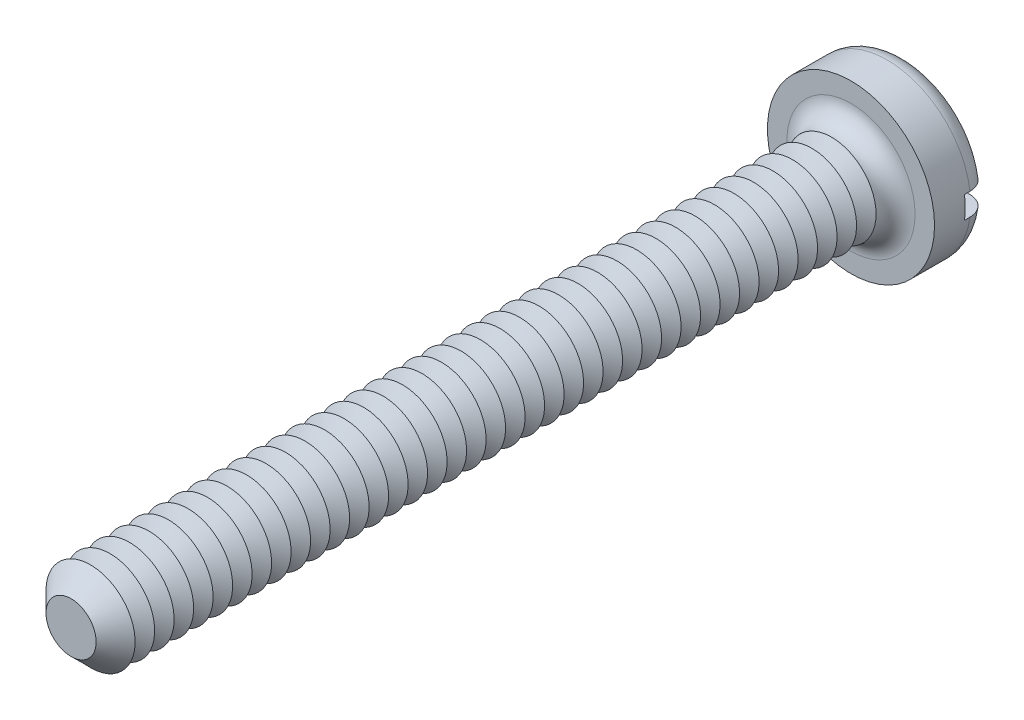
ISO-10303-21;
HEADER;
FILE_DESCRIPTION(('STEP AP214'),'2;1');
FILE_NAME('part.step','',(''),(''),'','','');
FILE_SCHEMA(('AUTOMOTIVE_DESIGN { 1 0 10303 214 1 1 1 1 }'));
ENDSEC;
DATA;
#1=APPLICATION_CONTEXT('core data for automotive mechanical design processes');
#2=APPLICATION_PROTOCOL_DEFINITION('international standard','automotive_design',2000,#1);
#3=PRODUCT_CONTEXT('',#1,'mechanical');
#4=PRODUCT('Part','Part','',(#3));
#5=PRODUCT_RELATED_PRODUCT_CATEGORY('part','',(#4));
#6=PRODUCT_DEFINITION_FORMATION('','',#4);
#7=PRODUCT_DEFINITION_CONTEXT('part definition',#1,'design');
#8=PRODUCT_DEFINITION('design','',#6,#7);
#9=PRODUCT_DEFINITION_SHAPE('','',#8);
#10=(LENGTH_UNIT() NAMED_UNIT(*) SI_UNIT(.MILLI.,.METRE.));
#11=(NAMED_UNIT(*) PLANE_ANGLE_UNIT() SI_UNIT($,.RADIAN.));
#12=(NAMED_UNIT(*) SI_UNIT($,.STERADIAN.) SOLID_ANGLE_UNIT());
#13=UNCERTAINTY_MEASURE_WITH_UNIT(LENGTH_MEASURE(1.E-05),#10,'distance_accuracy_value','');
#14=(GEOMETRIC_REPRESENTATION_CONTEXT(3) GLOBAL_UNCERTAINTY_ASSIGNED_CONTEXT((#13)) GLOBAL_UNIT_ASSIGNED_CONTEXT((#10,
#11,#12)) REPRESENTATION_CONTEXT('',''));
#15=CARTESIAN_POINT('',(0.,0.,0.));
#16=DIRECTION('',(0.,0.,1.));
#17=DIRECTION('',(1.,0.,0.));
#18=AXIS2_PLACEMENT_3D('',#15,#16,#17);
#19=CARTESIAN_POINT('',(0.,0.,-1.));
#20=DIRECTION('',(0.,0.,1.));
#21=DIRECTION('',(1.,0.,0.));
#22=AXIS2_PLACEMENT_3D('',#19,#20,#21);
#23=PLANE('',#22);
#24=CARTESIAN_POINT('',(0.,0.,-1.));
#25=DIRECTION('',(0.,0.,1.));
#26=DIRECTION('',(1.,0.,0.));
#27=AXIS2_PLACEMENT_3D('',#24,#25,#26);
#28=CIRCLE('',#27,1.15);
#29=CARTESIAN_POINT('',(-1.13247516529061,0.2,-1.));
#30=VERTEX_POINT('',#29);
#31=CARTESIAN_POINT('',(1.13247516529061,0.2,-1.));
#32=VERTEX_POINT('',#31);
#33=EDGE_CURVE('E116',#30,#32,#28,.F.);
#34=ORIENTED_EDGE('',*,*,#33,.T.);
#35=DIRECTION('',(1.,0.,0.));
#36=VECTOR('',#35,1.);
#37=CARTESIAN_POINT('',(-1.5,0.2,-1.));
#38=LINE('',#37,#36);
#39=EDGE_CURVE('E111',#30,#32,#38,.T.);
#40=ORIENTED_EDGE('',*,*,#39,.F.);
#41=EDGE_LOOP('',(#34,#40));
#42=FACE_BOUND('',#41,.T.);
#43=ADVANCED_FACE('F39',(#42),#23,.F.);
#44=CARTESIAN_POINT('',(0.,0.,-0.65));
#45=DIRECTION('',(0.,0.,1.));
#46=DIRECTION('',(1.,0.,0.));
#47=AXIS2_PLACEMENT_3D('',#44,#45,#46);
#48=TOROIDAL_SURFACE('',#47,1.15,0.35);
#49=CARTESIAN_POINT('',(-1.38697162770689,0.2,-0.89359719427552));
#50=CARTESIAN_POINT('',(-1.37305556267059,0.2,-0.907805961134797));
#51=CARTESIAN_POINT('',(-1.35791811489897,0.2,-0.9208403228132));
#52=CARTESIAN_POINT('',(-1.32565069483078,0.2,-0.944183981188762));
#53=CARTESIAN_POINT('',(-1.3085180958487,0.2,-0.954489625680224));
#54=CARTESIAN_POINT('',(-1.27278567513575,0.2,-0.972077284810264));
#55=CARTESIAN_POINT('',(-1.25418732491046,0.2,-0.979362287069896));
#56=CARTESIAN_POINT('',(-1.21604452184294,0.2,-0.990735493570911));
#57=CARTESIAN_POINT('',(-1.19650030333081,0.2,-0.994824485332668));
#58=CARTESIAN_POINT('',(-1.15682398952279,0.2,-0.99973845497));
#59=CARTESIAN_POINT('',(-1.1366881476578,0.2,-1.00053316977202));
#60=CARTESIAN_POINT('',(-1.09656272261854,0.2,-0.998770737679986));
#61=CARTESIAN_POINT('',(-1.07657315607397,0.2,-0.996213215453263));
#62=CARTESIAN_POINT('',(-1.03707277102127,0.2,-0.987780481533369));
#63=CARTESIAN_POINT('',(-1.01756977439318,0.2,-0.981868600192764));
#64=CARTESIAN_POINT('',(-0.979825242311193,0.2,-0.966867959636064));
#65=CARTESIAN_POINT('',(-0.961583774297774,0.2,-0.957779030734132));
#66=CARTESIAN_POINT('',(-0.926815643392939,0.2,-0.936628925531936));
#67=CARTESIAN_POINT('',(-0.910295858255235,0.2,-0.924556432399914));
#68=CARTESIAN_POINT('',(-0.879544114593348,0.2,-0.897781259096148));
#69=CARTESIAN_POINT('',(-0.8653120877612,0.2,-0.883078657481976));
#70=CARTESIAN_POINT('',(-0.83972745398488,0.2,-0.851619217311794));
#71=CARTESIAN_POINT('',(-0.8283448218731,0.2,-0.834886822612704));
#72=CARTESIAN_POINT('',(-0.80863848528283,0.2,-0.799707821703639));
#73=CARTESIAN_POINT('',(-0.80031425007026,0.2,-0.781261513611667));
#74=CARTESIAN_POINT('',(-0.787199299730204,0.2,-0.743695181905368));
#75=CARTESIAN_POINT('',(-0.782321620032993,0.2,-0.724605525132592));
#76=CARTESIAN_POINT('',(-0.775930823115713,0.2,-0.685871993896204));
#77=CARTESIAN_POINT('',(-0.774417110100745,0.2,-0.666228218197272));
#78=CARTESIAN_POINT('',(-0.774805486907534,0.2,-0.627456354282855));
#79=CARTESIAN_POINT('',(-0.776625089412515,0.2,-0.608327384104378));
#80=CARTESIAN_POINT('',(-0.783452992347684,0.2,-0.570648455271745));
#81=CARTESIAN_POINT('',(-0.788461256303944,0.2,-0.552098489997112));
#82=CARTESIAN_POINT('',(-0.801489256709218,0.2,-0.516098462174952));
#83=CARTESIAN_POINT('',(-0.809507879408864,0.2,-0.49864799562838));
#84=CARTESIAN_POINT('',(-0.828295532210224,0.2,-0.465297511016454));
#85=CARTESIAN_POINT('',(-0.839064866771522,0.2,-0.449397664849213));
#86=CARTESIAN_POINT('',(-0.863311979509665,0.2,-0.419196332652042));
#87=CARTESIAN_POINT('',(-0.876847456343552,0.2,-0.404941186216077));
#88=CARTESIAN_POINT('',(-0.906064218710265,0.2,-0.378832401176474));
#89=CARTESIAN_POINT('',(-0.921745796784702,0.2,-0.366979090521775));
#90=CARTESIAN_POINT('',(-0.955261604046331,0.2,-0.345690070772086));
#91=CARTESIAN_POINT('',(-0.973141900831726,0.2,-0.336326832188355));
#92=CARTESIAN_POINT('',(-1.01020647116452,0.2,-0.320690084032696));
#93=CARTESIAN_POINT('',(-1.02939085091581,0.2,-0.314416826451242));
#94=CARTESIAN_POINT('',(-1.06878849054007,0.2,-0.305073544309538));
#95=CARTESIAN_POINT('',(-1.0890118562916,0.2,-0.302046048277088));
#96=CARTESIAN_POINT('',(-1.12968032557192,0.2,-0.299436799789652));
#97=CARTESIAN_POINT('',(-1.15012542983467,0.2,-0.299855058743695));
#98=CARTESIAN_POINT('',(-1.1906059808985,0.2,-0.304138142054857));
#99=CARTESIAN_POINT('',(-1.21064224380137,0.2,-0.307995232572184));
#100=CARTESIAN_POINT('',(-1.24976957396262,0.2,-0.319055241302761));
#101=CARTESIAN_POINT('',(-1.26886068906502,0.2,-0.326257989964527));
#102=CARTESIAN_POINT('',(-1.30533597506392,0.2,-0.343725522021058));
#103=CARTESIAN_POINT('',(-1.32273620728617,0.2,-0.353956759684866));
#104=CARTESIAN_POINT('',(-1.35554323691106,0.2,-0.377229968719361));
#105=CARTESIAN_POINT('',(-1.37095016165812,0.2,-0.390271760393));
#106=CARTESIAN_POINT('',(-1.39913145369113,0.2,-0.418621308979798));
#107=CARTESIAN_POINT('',(-1.41193602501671,0.2,-0.43389904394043));
#108=CARTESIAN_POINT('',(-1.43476712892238,0.2,-0.46640589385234));
#109=CARTESIAN_POINT('',(-1.44479381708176,0.2,-0.483634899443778));
#110=CARTESIAN_POINT('',(-1.4616814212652,0.2,-0.519367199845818));
#111=CARTESIAN_POINT('',(-1.46857323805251,0.2,-0.537855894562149));
#112=CARTESIAN_POINT('',(-1.4791331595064,0.2,-0.575731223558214));
#113=CARTESIAN_POINT('',(-1.48280152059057,0.2,-0.595117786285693));
#114=CARTESIAN_POINT('',(-1.4867930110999,0.2,-0.634109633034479));
#115=CARTESIAN_POINT('',(-1.48713684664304,0.2,-0.653712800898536));
#116=CARTESIAN_POINT('',(-1.48452244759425,0.2,-0.692702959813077));
#117=CARTESIAN_POINT('',(-1.48156342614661,0.2,-0.712089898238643));
#118=CARTESIAN_POINT('',(-1.47243636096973,0.2,-0.75006822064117));
#119=CARTESIAN_POINT('',(-1.46627182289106,0.2,-0.768660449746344));
#120=CARTESIAN_POINT('',(-1.45092056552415,0.2,-0.804533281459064));
#121=CARTESIAN_POINT('',(-1.44173755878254,0.2,-0.821815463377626));
#122=CARTESIAN_POINT('',(-1.42477940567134,0.2,-0.848152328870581));
#123=CARTESIAN_POINT('',(-1.41786672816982,0.2,-0.857773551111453));
#124=CARTESIAN_POINT('',(-1.40310412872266,0.2,-0.876267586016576));
#125=CARTESIAN_POINT('',(-1.39525421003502,0.2,-0.885140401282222));
#126=CARTESIAN_POINT('',(-1.38697162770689,0.2,-0.89359719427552));
#127=B_SPLINE_CURVE_WITH_KNOTS('',3,(#49,#50,#51,#52,#53,#54,#55,#56,#57,#58,#59,#60,#61,#62,
#63,#64,#65,#66,#67,#68,#69,#70,#71,#72,#73,#74,#75,#76,#77,#78,#79,#80,#81,#82,#83,#84,#85,#86,
#87,#88,#89,#90,#91,#92,#93,#94,#95,#96,#97,#98,#99,#100,#101,#102,#103,#104,#105,#106,#107,
#108,#109,#110,#111,#112,#113,#114,#115,#116,#117,#118,#119,#120,#121,#122,#123,#124,#125,#126),
.UNSPECIFIED.,.T.,.F.,(4,2,2,2,2,2,2,2,2,2,2,2,2,2,2,2,2,2,2,2,2,2,2,2,2,2,2,2,2,2,2,2,2,2,2,2,
2,2,4),(0.,0.0596211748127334,0.119321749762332,0.178963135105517,0.238589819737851,
0.298763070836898,0.358943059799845,0.419793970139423,0.48064813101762,0.541736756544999,
0.602823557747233,0.663236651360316,0.72363925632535,0.782457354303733,0.841265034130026,
0.898637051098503,0.956008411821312,1.01335856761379,1.07071507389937,1.12941939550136,
1.18813172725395,1.24840147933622,1.30867614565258,1.36973127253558,1.43078660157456,
1.49170496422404,1.55262023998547,1.61288453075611,1.67314496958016,1.73266007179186,
1.792171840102,1.85108355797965,1.90999058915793,1.96853049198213,2.02708434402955,
2.08557429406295,2.14399257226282,2.17947810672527,2.21496351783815),.UNSPECIFIED.);
#128=CARTESIAN_POINT('',(-1.48660687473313,0.2,-0.649999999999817));
#129=VERTEX_POINT('',#128);
#130=EDGE_CURVE('E482',#129,#30,#127,.T.);
#131=ORIENTED_EDGE('',*,*,#130,.F.);
#132=CARTESIAN_POINT('',(0.,0.,-0.65));
#133=DIRECTION('',(0.,0.,1.));
#134=DIRECTION('',(1.,0.,0.));
#135=AXIS2_PLACEMENT_3D('',#132,#133,#134);
#136=CIRCLE('',#135,1.5);
#137=CARTESIAN_POINT('',(1.48660687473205,0.2,-0.649999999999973));
#138=VERTEX_POINT('',#137);
#139=EDGE_CURVE('E125',#138,#129,#136,.T.);
#140=ORIENTED_EDGE('',*,*,#139,.F.);
#141=CARTESIAN_POINT('',(0.780520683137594,0.2,-0.713112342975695));
#142=CARTESIAN_POINT('',(0.784146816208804,0.2,-0.73226748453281));
#143=CARTESIAN_POINT('',(0.789425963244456,0.2,-0.751125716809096));
#144=CARTESIAN_POINT('',(0.803106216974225,0.2,-0.78769198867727));
#145=CARTESIAN_POINT('',(0.811511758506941,0.2,-0.805398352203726));
#146=CARTESIAN_POINT('',(0.831144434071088,0.2,-0.839131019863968));
#147=CARTESIAN_POINT('',(0.842366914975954,0.2,-0.855160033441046));
#148=CARTESIAN_POINT('',(0.867288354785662,0.2,-0.88515062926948));
#149=CARTESIAN_POINT('',(0.880986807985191,0.2,-0.899112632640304));
#150=CARTESIAN_POINT('',(0.910770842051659,0.2,-0.924888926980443));
#151=CARTESIAN_POINT('',(0.926899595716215,0.2,-0.936653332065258));
#152=CARTESIAN_POINT('',(0.960871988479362,0.2,-0.957372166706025));
#153=CARTESIAN_POINT('',(0.978715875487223,0.2,-0.966326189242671));
#154=CARTESIAN_POINT('',(1.01600338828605,0.2,-0.981340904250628));
#155=CARTESIAN_POINT('',(1.03547204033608,0.2,-0.987339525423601));
#156=CARTESIAN_POINT('',(1.07513874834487,0.2,-0.995998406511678));
#157=CARTESIAN_POINT('',(1.09533683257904,0.2,-0.998658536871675));
#158=CARTESIAN_POINT('',(1.1359751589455,0.2,-1.0005575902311));
#159=CARTESIAN_POINT('',(1.1564160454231,0.2,-0.99978283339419));
#160=CARTESIAN_POINT('',(1.19687229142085,0.2,-0.994784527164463));
#161=CARTESIAN_POINT('',(1.21688766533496,0.2,-0.990561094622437));
#162=CARTESIAN_POINT('',(1.25575385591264,0.2,-0.978813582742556));
#163=CARTESIAN_POINT('',(1.27461259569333,0.2,-0.971315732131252));
#164=CARTESIAN_POINT('',(1.31078063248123,0.2,-0.953221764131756));
#165=CARTESIAN_POINT('',(1.32809002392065,0.2,-0.942625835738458));
#166=CARTESIAN_POINT('',(1.36044102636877,0.2,-0.918776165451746));
#167=CARTESIAN_POINT('',(1.37550786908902,0.2,-0.905556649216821));
#168=CARTESIAN_POINT('',(1.40317627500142,0.2,-0.876749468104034));
#169=CARTESIAN_POINT('',(1.41577799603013,0.2,-0.861161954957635));
#170=CARTESIAN_POINT('',(1.43800830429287,0.2,-0.828254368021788));
#171=CARTESIAN_POINT('',(1.44766923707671,0.2,-0.810956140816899));
#172=CARTESIAN_POINT('',(1.46392269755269,0.2,-0.774973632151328));
#173=CARTESIAN_POINT('',(1.4705153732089,0.2,-0.756289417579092));
#174=CARTESIAN_POINT('',(1.48039453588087,0.2,-0.718226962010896));
#175=CARTESIAN_POINT('',(1.48370713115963,0.2,-0.69885549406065));
#176=CARTESIAN_POINT('',(1.48701993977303,0.2,-0.659831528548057));
#177=CARTESIAN_POINT('',(1.4870202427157,0.2,-0.640179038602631));
#178=CARTESIAN_POINT('',(1.48371470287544,0.2,-0.6012267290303));
#179=CARTESIAN_POINT('',(1.48042091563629,0.2,-0.581925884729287));
#180=CARTESIAN_POINT('',(1.47064268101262,0.2,-0.544150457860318));
#181=CARTESIAN_POINT('',(1.46415824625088,0.2,-0.525675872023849));
#182=CARTESIAN_POINT('',(1.4481813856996,0.2,-0.490055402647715));
#183=CARTESIAN_POINT('',(1.43868601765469,0.2,-0.472910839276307));
#184=CARTESIAN_POINT('',(1.41696658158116,0.2,-0.440447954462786));
#185=CARTESIAN_POINT('',(1.40474246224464,0.2,-0.425129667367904));
#186=CARTESIAN_POINT('',(1.37784446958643,0.2,-0.39666049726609));
#187=CARTESIAN_POINT('',(1.36315749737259,0.2,-0.383521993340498));
#188=CARTESIAN_POINT('',(1.33180407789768,0.2,-0.359869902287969));
#189=CARTESIAN_POINT('',(1.31513754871,0.2,-0.349356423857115));
#190=CARTESIAN_POINT('',(1.28013085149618,0.2,-0.331143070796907));
#191=CARTESIAN_POINT('',(1.26177629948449,0.2,-0.323470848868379));
#192=CARTESIAN_POINT('',(1.224049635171,0.2,-0.311275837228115));
#193=CARTESIAN_POINT('',(1.20467746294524,0.2,-0.306753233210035));
#194=CARTESIAN_POINT('',(1.1652160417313,0.2,-0.300927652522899));
#195=CARTESIAN_POINT('',(1.14512096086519,0.2,-0.299664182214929));
#196=CARTESIAN_POINT('',(1.10499953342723,0.2,-0.300488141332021));
#197=CARTESIAN_POINT('',(1.08497319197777,0.2,-0.302575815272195));
#198=CARTESIAN_POINT('',(1.04531606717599,0.2,-0.310075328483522));
#199=CARTESIAN_POINT('',(1.0256923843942,0.2,-0.315524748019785));
#200=CARTESIAN_POINT('',(0.987629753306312,0.2,-0.329624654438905));
#201=CARTESIAN_POINT('',(0.96919087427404,0.2,-0.338275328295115));
#202=CARTESIAN_POINT('',(0.933939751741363,0.2,-0.358590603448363));
#203=CARTESIAN_POINT('',(0.917135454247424,0.2,-0.370269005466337));
#204=CARTESIAN_POINT('',(0.88574931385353,0.2,-0.396306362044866));
#205=CARTESIAN_POINT('',(0.87116734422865,0.2,-0.410665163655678));
#206=CARTESIAN_POINT('',(0.844813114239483,0.2,-0.441518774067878));
#207=CARTESIAN_POINT('',(0.833014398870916,0.2,-0.457990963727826));
#208=CARTESIAN_POINT('',(0.812431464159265,0.2,-0.492729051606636));
#209=CARTESIAN_POINT('',(0.803647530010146,0.2,-0.510995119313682));
#210=CARTESIAN_POINT('',(0.789590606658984,0.2,-0.548308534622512));
#211=CARTESIAN_POINT('',(0.784235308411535,0.2,-0.5673249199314));
#212=CARTESIAN_POINT('',(0.7768953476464,0.2,-0.605979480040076));
#213=CARTESIAN_POINT('',(0.774905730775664,0.2,-0.625616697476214));
#214=CARTESIAN_POINT('',(0.774470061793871,0.2,-0.656633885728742));
#215=CARTESIAN_POINT('',(0.7748847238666,0.2,-0.668009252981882));
#216=CARTESIAN_POINT('',(0.776852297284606,0.2,-0.690660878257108));
#217=CARTESIAN_POINT('',(0.77840517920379,0.2,-0.701937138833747));
#218=CARTESIAN_POINT('',(0.780520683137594,0.2,-0.713112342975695));
#219=B_SPLINE_CURVE_WITH_KNOTS('',3,(#141,#142,#143,#144,#145,#146,#147,#148,#149,#150,#151,
#152,#153,#154,#155,#156,#157,#158,#159,#160,#161,#162,#163,#164,#165,#166,#167,#168,#169,#170,
#171,#172,#173,#174,#175,#176,#177,#178,#179,#180,#181,#182,#183,#184,#185,#186,#187,#188,#189,
#190,#191,#192,#193,#194,#195,#196,#197,#198,#199,#200,#201,#202,#203,#204,#205,#206,#207,#208,
#209,#210,#211,#212,#213,#214,#215,#216,#217,#218),.UNSPECIFIED.,.T.,.F.,(4,2,2,2,2,2,2,2,2,2,2,
2,2,2,2,2,2,2,2,2,2,2,2,2,2,2,2,2,2,2,2,2,2,2,2,2,2,2,4),(0.,0.0584431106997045,
0.11696944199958,0.175399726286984,0.233818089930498,0.293433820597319,0.353058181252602,
0.413886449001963,0.474717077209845,0.53579018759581,0.596861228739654,0.65745180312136,
0.718038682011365,0.777881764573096,0.837721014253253,0.896876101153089,0.95602833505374,
1.01470585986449,1.07338179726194,1.13184377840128,1.19030552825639,1.24882458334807,
1.30734473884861,1.36618662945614,1.42503095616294,1.48443380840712,1.54384016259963,
1.60396331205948,1.66409084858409,1.72490303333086,1.78571877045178,1.84681674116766,
1.90791122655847,1.96839922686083,2.02889294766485,2.08787382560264,2.14676780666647,
2.18086468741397,2.21496068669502),.UNSPECIFIED.);
#220=EDGE_CURVE('E484',#32,#138,#219,.T.);
#221=ORIENTED_EDGE('',*,*,#220,.F.);
#222=ORIENTED_EDGE('',*,*,#33,.F.);
#223=EDGE_LOOP('',(#131,#140,#221,#222));
#224=FACE_BOUND('',#223,.T.);
#225=ADVANCED_FACE('F466',(#224),#48,.T.);
#226=CARTESIAN_POINT('',(0.,0.,-1.));
#227=DIRECTION('',(0.,0.,1.));
#228=DIRECTION('',(1.,0.,0.));
#229=AXIS2_PLACEMENT_3D('',#226,#227,#228);
#230=CYLINDRICAL_SURFACE('',#229,1.5);
#231=DIRECTION('',(0.,0.,1.));
#232=VECTOR('',#231,1.);
#233=CARTESIAN_POINT('',(1.48660687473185,0.2,-1.));
#234=LINE('',#233,#232);
#235=CARTESIAN_POINT('',(1.48660687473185,0.2,-0.55));
#236=VERTEX_POINT('',#235);
#237=EDGE_CURVE('E500',#138,#236,#234,.T.);
#238=ORIENTED_EDGE('',*,*,#237,.F.);
#239=ORIENTED_EDGE('',*,*,#139,.T.);
#240=DIRECTION('',(0.,0.,1.));
#241=VECTOR('',#240,1.);
#242=CARTESIAN_POINT('',(-1.48660687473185,0.2,-1.));
#243=LINE('',#242,#241);
#244=CARTESIAN_POINT('',(-1.48660687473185,0.2,-0.55));
#245=VERTEX_POINT('',#244);
#246=EDGE_CURVE('E63',#245,#129,#243,.F.);
#247=ORIENTED_EDGE('',*,*,#246,.F.);
#248=CARTESIAN_POINT('',(0.,0.,-0.55));
#249=DIRECTION('',(0.,0.,-1.));
#250=DIRECTION('',(-1.,0.,0.));
#251=AXIS2_PLACEMENT_3D('',#248,#249,#250);
#252=CIRCLE('',#251,1.5);
#253=CARTESIAN_POINT('',(-1.48660687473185,-0.2,-0.55));
#254=VERTEX_POINT('',#253);
#255=EDGE_CURVE('E43',#245,#254,#252,.F.);
#256=ORIENTED_EDGE('',*,*,#255,.T.);
#257=DIRECTION('',(0.,0.,1.));
#258=VECTOR('',#257,1.);
#259=CARTESIAN_POINT('',(-1.48660687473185,-0.2,-1.));
#260=LINE('',#259,#258);
#261=CARTESIAN_POINT('',(-1.48660687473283,-0.2,-0.650000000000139));
#262=VERTEX_POINT('',#261);
#263=EDGE_CURVE('E497',#262,#254,#260,.T.);
#264=ORIENTED_EDGE('',*,*,#263,.F.);
#265=CARTESIAN_POINT('',(1.48660687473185,-0.2,-0.65));
#266=VERTEX_POINT('',#265);
#267=EDGE_CURVE('E127',#262,#266,#136,.T.);
#268=ORIENTED_EDGE('',*,*,#267,.T.);
#269=DIRECTION('',(0.,0.,1.));
#270=VECTOR('',#269,1.);
#271=CARTESIAN_POINT('',(1.48660687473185,-0.2,-1.));
#272=LINE('',#271,#270);
#273=CARTESIAN_POINT('',(1.48660687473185,-0.2,-0.55));
#274=VERTEX_POINT('',#273);
#275=EDGE_CURVE('E55',#274,#266,#272,.F.);
#276=ORIENTED_EDGE('',*,*,#275,.F.);
#277=EDGE_CURVE('E11',#274,#236,#252,.F.);
#278=ORIENTED_EDGE('',*,*,#277,.T.);
#279=EDGE_LOOP('',(#238,#239,#247,#256,#264,#268,#276,#278));
#280=FACE_BOUND('',#279,.T.);
#281=CARTESIAN_POINT('',(0.,0.,0.));
#282=DIRECTION('',(0.,0.,1.));
#283=DIRECTION('',(1.,0.,0.));
#284=AXIS2_PLACEMENT_3D('',#281,#282,#283);
#285=CIRCLE('',#284,1.5);
#286=CARTESIAN_POINT('',(1.5,0.,0.));
#287=VERTEX_POINT('',#286);
#288=EDGE_CURVE('E503',#287,#287,#285,.T.);
#289=ORIENTED_EDGE('',*,*,#288,.F.);
#290=EDGE_LOOP('',(#289));
#291=FACE_BOUND('',#290,.T.);
#292=ADVANCED_FACE('F462',(#280,#291),#230,.T.);
#293=CARTESIAN_POINT('',(1.13247516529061,-0.2,-1.));
#294=VERTEX_POINT('',#293);
#295=CARTESIAN_POINT('',(-1.13247516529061,-0.2,-1.));
#296=VERTEX_POINT('',#295);
#297=EDGE_CURVE('E109',#294,#296,#28,.F.);
#298=ORIENTED_EDGE('',*,*,#297,.T.);
#299=DIRECTION('',(-1.,0.,0.));
#300=VECTOR('',#299,1.);
#301=CARTESIAN_POINT('',(-1.5,-0.2,-1.));
#302=LINE('',#301,#300);
#303=EDGE_CURVE('E96',#294,#296,#302,.T.);
#304=ORIENTED_EDGE('',*,*,#303,.F.);
#305=EDGE_LOOP('',(#298,#304));
#306=FACE_BOUND('',#305,.T.);
#307=ADVANCED_FACE('F108',(#306),#23,.F.);
#308=CARTESIAN_POINT('',(0.,0.,0.));
#309=DIRECTION('',(0.,0.,1.));
#310=DIRECTION('',(1.,0.,0.));
#311=AXIS2_PLACEMENT_3D('',#308,#309,#310);
#312=PLANE('',#311);
#313=CARTESIAN_POINT('',(0.,0.,0.));
#314=DIRECTION('',(0.,0.,1.));
#315=DIRECTION('',(1.,0.,0.));
#316=AXIS2_PLACEMENT_3D('',#313,#314,#315);
#317=CIRCLE('',#316,1.15);
#318=CARTESIAN_POINT('',(1.15,0.,0.));
#319=VERTEX_POINT('',#318);
#320=EDGE_CURVE('E115',#319,#319,#317,.F.);
#321=ORIENTED_EDGE('',*,*,#320,.T.);
#322=EDGE_LOOP('',(#321));
#323=FACE_BOUND('',#322,.T.);
#324=ORIENTED_EDGE('',*,*,#288,.T.);
#325=EDGE_LOOP('',(#324));
#326=FACE_BOUND('',#325,.T.);
#327=ADVANCED_FACE('F461',(#323,#326),#312,.T.);
#328=CARTESIAN_POINT('',(-1.38697162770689,-0.2,-0.89359719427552));
#329=CARTESIAN_POINT('',(-1.40068341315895,-0.2,-0.87959447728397));
#330=CARTESIAN_POINT('',(-1.41322919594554,-0.2,-0.864431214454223));
#331=CARTESIAN_POINT('',(-1.43561095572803,-0.2,-0.83220389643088));
#332=CARTESIAN_POINT('',(-1.44544396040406,-0.2,-0.815137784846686));
#333=CARTESIAN_POINT('',(-1.46209732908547,-0.2,-0.779595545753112));
#334=CARTESIAN_POINT('',(-1.46891825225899,-0.2,-0.761119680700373));
#335=CARTESIAN_POINT('',(-1.479344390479,-0.2,-0.723286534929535));
#336=CARTESIAN_POINT('',(-1.48295036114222,-0.2,-0.703929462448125));
#337=CARTESIAN_POINT('',(-1.48683413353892,-0.2,-0.6649653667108));
#338=CARTESIAN_POINT('',(-1.48712565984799,-0.2,-0.645359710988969));
#339=CARTESIAN_POINT('',(-1.48440736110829,-0.2,-0.606378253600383));
#340=CARTESIAN_POINT('',(-1.48139747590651,-0.2,-0.587002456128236));
#341=CARTESIAN_POINT('',(-1.47217267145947,-0.2,-0.549061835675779));
#342=CARTESIAN_POINT('',(-1.46596274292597,-0.2,-0.530495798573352));
#343=CARTESIAN_POINT('',(-1.45052327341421,-0.2,-0.494665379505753));
#344=CARTESIAN_POINT('',(-1.44129371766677,-0.2,-0.477401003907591));
#345=CARTESIAN_POINT('',(-1.42005139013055,-0.2,-0.444603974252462));
#346=CARTESIAN_POINT('',(-1.40803014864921,-0.2,-0.429076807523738));
#347=CARTESIAN_POINT('',(-1.38156905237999,-0.2,-0.400242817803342));
#348=CARTESIAN_POINT('',(-1.36712913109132,-0.2,-0.386936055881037));
#349=CARTESIAN_POINT('',(-1.33612890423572,-0.2,-0.362811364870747));
#350=CARTESIAN_POINT('',(-1.31955365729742,-0.2,-0.352012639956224));
#351=CARTESIAN_POINT('',(-1.28484098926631,-0.2,-0.333316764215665));
#352=CARTESIAN_POINT('',(-1.26670348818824,-0.2,-0.325419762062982));
#353=CARTESIAN_POINT('',(-1.22917040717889,-0.2,-0.31265726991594));
#354=CARTESIAN_POINT('',(-1.20976324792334,-0.2,-0.3078258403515));
#355=CARTESIAN_POINT('',(-1.17041685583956,-0.2,-0.30144641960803));
#356=CARTESIAN_POINT('',(-1.15047758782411,-0.2,-0.299898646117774));
#357=CARTESIAN_POINT('',(-1.11037109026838,-0.2,-0.300112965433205));
#358=CARTESIAN_POINT('',(-1.09020407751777,-0.2,-0.301916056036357));
#359=CARTESIAN_POINT('',(-1.05044996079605,-0.2,-0.308849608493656));
#360=CARTESIAN_POINT('',(-1.03086289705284,-0.2,-0.313980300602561));
#361=CARTESIAN_POINT('',(-0.992636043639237,-0.2,-0.327485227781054));
#362=CARTESIAN_POINT('',(-0.974006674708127,-0.2,-0.335888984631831));
#363=CARTESIAN_POINT('',(-0.938423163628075,-0.2,-0.355707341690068));
#364=CARTESIAN_POINT('',(-0.921469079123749,-0.2,-0.367122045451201));
#365=CARTESIAN_POINT('',(-0.889752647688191,-0.2,-0.392642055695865));
#366=CARTESIAN_POINT('',(-0.874987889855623,-0.2,-0.406744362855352));
#367=CARTESIAN_POINT('',(-0.848085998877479,-0.2,-0.437266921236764));
#368=CARTESIAN_POINT('',(-0.835948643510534,-0.2,-0.453686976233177));
#369=CARTESIAN_POINT('',(-0.814894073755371,-0.2,-0.488078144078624));
#370=CARTESIAN_POINT('',(-0.805923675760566,-0.2,-0.506016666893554));
#371=CARTESIAN_POINT('',(-0.791223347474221,-0.2,-0.543175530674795));
#372=CARTESIAN_POINT('',(-0.78549275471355,-0.2,-0.562395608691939));
#373=CARTESIAN_POINT('',(-0.777599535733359,-0.2,-0.600984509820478));
#374=CARTESIAN_POINT('',(-0.775340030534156,-0.2,-0.62033354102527));
#375=CARTESIAN_POINT('',(-0.774164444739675,-0.2,-0.659131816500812));
#376=CARTESIAN_POINT('',(-0.775247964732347,-0.2,-0.678581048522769));
#377=CARTESIAN_POINT('',(-0.78067015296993,-0.2,-0.716679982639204));
#378=CARTESIAN_POINT('',(-0.784953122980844,-0.2,-0.735337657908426));
#379=CARTESIAN_POINT('',(-0.796558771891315,-0.2,-0.771681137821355));
#380=CARTESIAN_POINT('',(-0.803881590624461,-0.2,-0.789366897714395));
#381=CARTESIAN_POINT('',(-0.821417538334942,-0.2,-0.823475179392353));
#382=CARTESIAN_POINT('',(-0.831660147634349,-0.2,-0.839882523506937));
#383=CARTESIAN_POINT('',(-0.854684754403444,-0.2,-0.870805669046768));
#384=CARTESIAN_POINT('',(-0.867467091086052,-0.2,-0.885321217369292));
#385=CARTESIAN_POINT('',(-0.895584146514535,-0.2,-0.912470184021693));
#386=CARTESIAN_POINT('',(-0.910979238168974,-0.2,-0.925041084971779));
#387=CARTESIAN_POINT('',(-0.943622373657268,-0.2,-0.947488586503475));
#388=CARTESIAN_POINT('',(-0.960870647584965,-0.2,-0.957364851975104));
#389=CARTESIAN_POINT('',(-0.997151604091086,-0.2,-0.974359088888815));
#390=CARTESIAN_POINT('',(-1.01621564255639,-0.2,-0.98141019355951));
#391=CARTESIAN_POINT('',(-1.05525219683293,-0.2,-0.992235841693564));
#392=CARTESIAN_POINT('',(-1.07522472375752,-0.2,-0.996010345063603));
#393=CARTESIAN_POINT('',(-1.11565152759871,-0.2,-1.00018247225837));
#394=CARTESIAN_POINT('',(-1.1361080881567,-0.2,-1.00055804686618));
#395=CARTESIAN_POINT('',(-1.17679659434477,-0.2,-0.997846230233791));
#396=CARTESIAN_POINT('',(-1.19702848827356,-0.2,-0.994758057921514));
#397=CARTESIAN_POINT('',(-1.23655375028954,-0.2,-0.985216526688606));
#398=CARTESIAN_POINT('',(-1.25585198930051,-0.2,-0.978783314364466));
#399=CARTESIAN_POINT('',(-1.29305658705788,-0.2,-0.962732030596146));
#400=CARTESIAN_POINT('',(-1.31096467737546,-0.2,-0.953118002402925));
#401=CARTESIAN_POINT('',(-1.33859353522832,-0.2,-0.935076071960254));
#402=CARTESIAN_POINT('',(-1.34889525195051,-0.2,-0.927521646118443));
#403=CARTESIAN_POINT('',(-1.36861998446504,-0.2,-0.911341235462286));
#404=CARTESIAN_POINT('',(-1.37804300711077,-0.2,-0.90271525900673));
#405=CARTESIAN_POINT('',(-1.38697162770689,-0.2,-0.89359719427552));
#406=B_SPLINE_CURVE_WITH_KNOTS('',3,(#328,#329,#330,#331,#332,#333,#334,#335,#336,#337,#338,
#339,#340,#341,#342,#343,#344,#345,#346,#347,#348,#349,#350,#351,#352,#353,#354,#355,#356,#357,
#358,#359,#360,#361,#362,#363,#364,#365,#366,#367,#368,#369,#370,#371,#372,#373,#374,#375,#376,
#377,#378,#379,#380,#381,#382,#383,#384,#385,#386,#387,#388,#389,#390,#391,#392,#393,#394,#395,
#396,#397,#398,#399,#400,#401,#402,#403,#404,#405),.UNSPECIFIED.,.T.,.F.,(4,2,2,2,2,2,2,2,2,2,2,
2,2,2,2,2,2,2,2,2,2,2,2,2,2,2,2,2,2,2,2,2,2,2,2,2,2,2,4),(0.,0.0587484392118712,
0.117560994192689,0.17636262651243,0.235150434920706,0.293694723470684,0.352240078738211,
0.410694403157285,0.46914901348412,0.527783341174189,0.586419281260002,0.645490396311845,
0.704564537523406,0.76428403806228,0.824007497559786,0.884466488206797,0.944929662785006,
1.00595131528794,1.06697506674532,1.12793111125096,1.18888199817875,1.2487542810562,
1.30861431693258,1.36677117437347,1.4249210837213,1.48208160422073,1.53924475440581,
1.59700685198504,1.65477666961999,1.71413044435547,1.77349159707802,1.83418476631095,
1.89487867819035,1.95596603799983,2.01706717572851,2.07780450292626,2.13846491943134,
2.17672008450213,2.21497495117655),.UNSPECIFIED.);
#407=EDGE_CURVE('E103',#296,#262,#406,.T.);
#408=ORIENTED_EDGE('',*,*,#407,.F.);
#409=ORIENTED_EDGE('',*,*,#297,.F.);
#410=CARTESIAN_POINT('',(0.780520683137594,-0.2,-0.713112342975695));
#411=CARTESIAN_POINT('',(0.776967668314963,-0.2,-0.694332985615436));
#412=CARTESIAN_POINT('',(0.774997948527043,-0.2,-0.675240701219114));
#413=CARTESIAN_POINT('',(0.774305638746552,-0.2,-0.636983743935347));
#414=CARTESIAN_POINT('',(0.775586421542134,-0.2,-0.617819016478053));
#415=CARTESIAN_POINT('',(0.781350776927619,-0.2,-0.579992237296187));
#416=CARTESIAN_POINT('',(0.78583187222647,-0.2,-0.56132980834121));
#417=CARTESIAN_POINT('',(0.797836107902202,-0.2,-0.525016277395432));
#418=CARTESIAN_POINT('',(0.805358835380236,-0.2,-0.507365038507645));
#419=CARTESIAN_POINT('',(0.823276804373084,-0.2,-0.47338978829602));
#420=CARTESIAN_POINT('',(0.833696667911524,-0.2,-0.457078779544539));
#421=CARTESIAN_POINT('',(0.857057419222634,-0.2,-0.426375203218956));
#422=CARTESIAN_POINT('',(0.869998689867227,-0.2,-0.411982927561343));
#423=CARTESIAN_POINT('',(0.898418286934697,-0.2,-0.38510575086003));
#424=CARTESIAN_POINT('',(0.913956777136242,-0.2,-0.372684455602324));
#425=CARTESIAN_POINT('',(0.946860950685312,-0.2,-0.350558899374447));
#426=CARTESIAN_POINT('',(0.964226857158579,-0.2,-0.340854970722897));
#427=CARTESIAN_POINT('',(1.00070854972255,-0.2,-0.324232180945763));
#428=CARTESIAN_POINT('',(1.01985442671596,-0.2,-0.317379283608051));
#429=CARTESIAN_POINT('',(1.0590214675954,-0.2,-0.306962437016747));
#430=CARTESIAN_POINT('',(1.07904267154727,-0.2,-0.303398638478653));
#431=CARTESIAN_POINT('',(1.11952320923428,-0.2,-0.299657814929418));
#432=CARTESIAN_POINT('',(1.13998446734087,-0.2,-0.299501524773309));
#433=CARTESIAN_POINT('',(1.1806395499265,-0.2,-0.302650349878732));
#434=CARTESIAN_POINT('',(1.20083338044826,-0.2,-0.305955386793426));
#435=CARTESIAN_POINT('',(1.24023260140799,-0.2,-0.315918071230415));
#436=CARTESIAN_POINT('',(1.25944372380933,-0.2,-0.322553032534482));
#437=CARTESIAN_POINT('',(1.29645854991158,-0.2,-0.338992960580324));
#438=CARTESIAN_POINT('',(1.31426233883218,-0.2,-0.348797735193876));
#439=CARTESIAN_POINT('',(1.34772734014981,-0.2,-0.371172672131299));
#440=CARTESIAN_POINT('',(1.36341179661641,-0.2,-0.383708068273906));
#441=CARTESIAN_POINT('',(1.39242189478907,-0.2,-0.41126267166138));
#442=CARTESIAN_POINT('',(1.40574768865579,-0.2,-0.426281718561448));
#443=CARTESIAN_POINT('',(1.42949833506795,-0.2,-0.458186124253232));
#444=CARTESIAN_POINT('',(1.43995542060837,-0.2,-0.475047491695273));
#445=CARTESIAN_POINT('',(1.45786189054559,-0.2,-0.510298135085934));
#446=CARTESIAN_POINT('',(1.46531142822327,-0.2,-0.528687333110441));
#447=CARTESIAN_POINT('',(1.47692889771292,-0.2,-0.566301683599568));
#448=CARTESIAN_POINT('',(1.48112438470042,-0.2,-0.585518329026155));
#449=CARTESIAN_POINT('',(1.48621428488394,-0.2,-0.624383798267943));
#450=CARTESIAN_POINT('',(1.48710879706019,-0.2,-0.644032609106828));
#451=CARTESIAN_POINT('',(1.48557356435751,-0.2,-0.683115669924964));
#452=CARTESIAN_POINT('',(1.48315796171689,-0.2,-0.702550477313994));
#453=CARTESIAN_POINT('',(1.47509909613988,-0.2,-0.740738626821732));
#454=CARTESIAN_POINT('',(1.46945585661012,-0.2,-0.759491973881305));
#455=CARTESIAN_POINT('',(1.45510530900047,-0.2,-0.79579446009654));
#456=CARTESIAN_POINT('',(1.44639690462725,-0.2,-0.813343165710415));
#457=CARTESIAN_POINT('',(1.42617120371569,-0.2,-0.846738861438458));
#458=CARTESIAN_POINT('',(1.41465386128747,-0.2,-0.862585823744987));
#459=CARTESIAN_POINT('',(1.3890808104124,-0.2,-0.892214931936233));
#460=CARTESIAN_POINT('',(1.37501291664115,-0.2,-0.90598655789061));
#461=CARTESIAN_POINT('',(1.34478283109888,-0.2,-0.930997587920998));
#462=CARTESIAN_POINT('',(1.32862056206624,-0.2,-0.942236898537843));
#463=CARTESIAN_POINT('',(1.29450693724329,-0.2,-0.96197581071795));
#464=CARTESIAN_POINT('',(1.27654077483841,-0.2,-0.970449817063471));
#465=CARTESIAN_POINT('',(1.23945233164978,-0.2,-0.984300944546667));
#466=CARTESIAN_POINT('',(1.2203299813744,-0.2,-0.989677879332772));
#467=CARTESIAN_POINT('',(1.18123021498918,-0.2,-0.997250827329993));
#468=CARTESIAN_POINT('',(1.16124534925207,-0.2,-0.999408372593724));
#469=CARTESIAN_POINT('',(1.12119456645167,-0.2,-1.00037966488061));
#470=CARTESIAN_POINT('',(1.10112864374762,-0.2,-0.999193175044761));
#471=CARTESIAN_POINT('',(1.06123417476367,-0.2,-0.993489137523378));
#472=CARTESIAN_POINT('',(1.0414112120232,-0.2,-0.988932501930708));
#473=CARTESIAN_POINT('',(1.00280276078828,-0.2,-0.976576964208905));
#474=CARTESIAN_POINT('',(0.984017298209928,-0.2,-0.968777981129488));
#475=CARTESIAN_POINT('',(0.947906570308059,-0.2,-0.95009587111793));
#476=CARTESIAN_POINT('',(0.930590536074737,-0.2,-0.939194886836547));
#477=CARTESIAN_POINT('',(0.89804559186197,-0.2,-0.914617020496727));
#478=CARTESIAN_POINT('',(0.882817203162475,-0.2,-0.900939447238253));
#479=CARTESIAN_POINT('',(0.855020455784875,-0.2,-0.871287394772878));
#480=CARTESIAN_POINT('',(0.84243415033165,-0.2,-0.855329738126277));
#481=CARTESIAN_POINT('',(0.820210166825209,-0.2,-0.821497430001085));
#482=CARTESIAN_POINT('',(0.810568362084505,-0.2,-0.803625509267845));
#483=CARTESIAN_POINT('',(0.797588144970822,-0.2,-0.773519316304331));
#484=CARTESIAN_POINT('',(0.793244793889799,-0.2,-0.761708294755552));
#485=CARTESIAN_POINT('',(0.785879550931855,-0.2,-0.737680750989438));
#486=CARTESIAN_POINT('',(0.782857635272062,-0.2,-0.725464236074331));
#487=CARTESIAN_POINT('',(0.780520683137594,-0.2,-0.713112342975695));
#488=B_SPLINE_CURVE_WITH_KNOTS('',3,(#410,#411,#412,#413,#414,#415,#416,#417,#418,#419,#420,
#421,#422,#423,#424,#425,#426,#427,#428,#429,#430,#431,#432,#433,#434,#435,#436,#437,#438,#439,
#440,#441,#442,#443,#444,#445,#446,#447,#448,#449,#450,#451,#452,#453,#454,#455,#456,#457,#458,
#459,#460,#461,#462,#463,#464,#465,#466,#467,#468,#469,#470,#471,#472,#473,#474,#475,#476,#477,
#478,#479,#480,#481,#482,#483,#484,#485,#486,#487),.UNSPECIFIED.,.T.,.F.,(4,2,2,2,2,2,2,2,2,2,2,
2,2,2,2,2,2,2,2,2,2,2,2,2,2,2,2,2,2,2,2,2,2,2,2,2,2,2,4),(0.,0.057291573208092,
0.114642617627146,0.171949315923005,0.229248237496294,0.287049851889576,0.344860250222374,
0.404266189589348,0.463679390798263,0.524399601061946,0.585122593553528,0.646214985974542,
0.707305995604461,0.767986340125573,0.828663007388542,0.888608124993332,0.948549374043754,
1.00778662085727,1.06702084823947,1.12574783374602,1.18447305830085,1.24294816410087,
1.30142284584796,1.35991846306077,1.41841503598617,1.47719881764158,1.5359847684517,
1.59530034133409,1.65461948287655,1.71464189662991,1.77466856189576,1.83540257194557,
1.89613809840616,1.9572305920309,2.01833831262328,2.0790164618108,2.13960917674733,
2.17729268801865,2.21497552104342),.UNSPECIFIED.);
#489=EDGE_CURVE('E92',#266,#294,#488,.T.);
#490=ORIENTED_EDGE('',*,*,#489,.F.);
#491=ORIENTED_EDGE('',*,*,#267,.F.);
#492=EDGE_LOOP('',(#408,#409,#490,#491));
#493=FACE_BOUND('',#492,.T.);
#494=ADVANCED_FACE('F113',(#493),#48,.T.);
#495=CARTESIAN_POINT('',(0.,0.,0.35));
#496=DIRECTION('',(0.,0.,1.));
#497=DIRECTION('',(1.,0.,0.));
#498=AXIS2_PLACEMENT_3D('',#495,#496,#497);
#499=TOROIDAL_SURFACE('',#498,1.15,0.35);
#500=ORIENTED_EDGE('',*,*,#320,.F.);
#501=EDGE_LOOP('',(#500));
#502=FACE_BOUND('',#501,.T.);
#503=CARTESIAN_POINT('',(0.,0.,0.35));
#504=DIRECTION('',(0.,0.,-1.));
#505=DIRECTION('',(-1.,0.,0.));
#506=AXIS2_PLACEMENT_3D('',#503,#504,#505);
#507=CIRCLE('',#506,0.8);
#508=CARTESIAN_POINT('',(-0.8,0.,0.35));
#509=VERTEX_POINT('',#508);
#510=EDGE_CURVE('E509',#509,#509,#507,.T.);
#511=ORIENTED_EDGE('',*,*,#510,.T.);
#512=EDGE_LOOP('',(#511));
#513=FACE_BOUND('',#512,.T.);
#514=ADVANCED_FACE('F454',(#502,#513),#499,.F.);
#515=CARTESIAN_POINT('',(0.,0.,0.524999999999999));
#516=DIRECTION('',(0.,0.,-1.));
#517=DIRECTION('',(-1.,0.,0.));
#518=AXIS2_PLACEMENT_3D('',#515,#516,#517);
#519=CONICAL_SURFACE('',#518,0.496891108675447,1.0471975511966);
#520=ORIENTED_EDGE('',*,*,#510,.F.);
#521=EDGE_LOOP('',(#520));
#522=FACE_BOUND('',#521,.T.);
#523=CARTESIAN_POINT('',(0.,0.,0.524999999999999));
#524=DIRECTION('',(0.,0.,-1.));
#525=DIRECTION('',(-1.,0.,0.));
#526=AXIS2_PLACEMENT_3D('',#523,#524,#525);
#527=CIRCLE('',#526,0.496891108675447);
#528=CARTESIAN_POINT('',(-0.496891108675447,0.,0.524999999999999));
#529=VERTEX_POINT('',#528);
#530=EDGE_CURVE('E515',#529,#529,#527,.T.);
#531=ORIENTED_EDGE('',*,*,#530,.T.);
#532=EDGE_LOOP('',(#531));
#533=FACE_BOUND('',#532,.T.);
#534=ADVANCED_FACE('F450',(#522,#533),#519,.T.);
#535=CARTESIAN_POINT('',(0.,0.,0.7));
#536=DIRECTION('',(0.,0.,1.));
#537=DIRECTION('',(1.,0.,0.));
#538=AXIS2_PLACEMENT_3D('',#535,#536,#537);
#539=CONICAL_SURFACE('',#538,0.8,1.0471975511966);
#540=ORIENTED_EDGE('',*,*,#530,.F.);
#541=EDGE_LOOP('',(#540));
#542=FACE_BOUND('',#541,.T.);
#543=CARTESIAN_POINT('',(0.,0.,0.7));
#544=DIRECTION('',(0.,0.,-1.));
#545=DIRECTION('',(-1.,0.,0.));
#546=AXIS2_PLACEMENT_3D('',#543,#544,#545);
#547=CIRCLE('',#546,0.8);
#548=CARTESIAN_POINT('',(-0.8,0.,0.7));
#549=VERTEX_POINT('',#548);
#550=EDGE_CURVE('E521',#549,#549,#547,.T.);
#551=ORIENTED_EDGE('',*,*,#550,.T.);
#552=EDGE_LOOP('',(#551));
#553=FACE_BOUND('',#552,.T.);
#554=ADVANCED_FACE('F446',(#542,#553),#539,.T.);
#555=CARTESIAN_POINT('',(0.,0.,0.874999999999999));
#556=DIRECTION('',(0.,0.,-1.));
#557=DIRECTION('',(-1.,0.,0.));
#558=AXIS2_PLACEMENT_3D('',#555,#556,#557);
#559=CONICAL_SURFACE('',#558,0.496891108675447,1.0471975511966);
#560=ORIENTED_EDGE('',*,*,#550,.F.);
#561=EDGE_LOOP('',(#560));
#562=FACE_BOUND('',#561,.T.);
#563=CARTESIAN_POINT('',(0.,0.,0.874999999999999));
#564=DIRECTION('',(0.,0.,-1.));
#565=DIRECTION('',(-1.,0.,0.));
#566=AXIS2_PLACEMENT_3D('',#563,#564,#565);
#567=CIRCLE('',#566,0.496891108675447);
#568=CARTESIAN_POINT('',(-0.496891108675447,0.,0.874999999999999));
#569=VERTEX_POINT('',#568);
#570=EDGE_CURVE('E525',#569,#569,#567,.T.);
#571=ORIENTED_EDGE('',*,*,#570,.T.);
#572=EDGE_LOOP('',(#571));
#573=FACE_BOUND('',#572,.T.);
#574=ADVANCED_FACE('F442',(#562,#573),#559,.T.);
#575=CARTESIAN_POINT('',(0.,0.,1.05));
#576=DIRECTION('',(0.,0.,1.));
#577=DIRECTION('',(1.,0.,0.));
#578=AXIS2_PLACEMENT_3D('',#575,#576,#577);
#579=CONICAL_SURFACE('',#578,0.8,1.0471975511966);
#580=ORIENTED_EDGE('',*,*,#570,.F.);
#581=EDGE_LOOP('',(#580));
#582=FACE_BOUND('',#581,.T.);
#583=CARTESIAN_POINT('',(0.,0.,1.05));
#584=DIRECTION('',(0.,0.,-1.));
#585=DIRECTION('',(-1.,0.,0.));
#586=AXIS2_PLACEMENT_3D('',#583,#584,#585);
#587=CIRCLE('',#586,0.8);
#588=CARTESIAN_POINT('',(-0.8,0.,1.05));
#589=VERTEX_POINT('',#588);
#590=EDGE_CURVE('E529',#589,#589,#587,.T.);
#591=ORIENTED_EDGE('',*,*,#590,.T.);
#592=EDGE_LOOP('',(#591));
#593=FACE_BOUND('',#592,.T.);
#594=ADVANCED_FACE('F438',(#582,#593),#579,.T.);
#595=CARTESIAN_POINT('',(0.,0.,1.225));
#596=DIRECTION('',(0.,0.,-1.));
#597=DIRECTION('',(-1.,0.,0.));
#598=AXIS2_PLACEMENT_3D('',#595,#596,#597);
#599=CONICAL_SURFACE('',#598,0.496891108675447,1.0471975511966);
#600=ORIENTED_EDGE('',*,*,#590,.F.);
#601=EDGE_LOOP('',(#600));
#602=FACE_BOUND('',#601,.T.);
#603=CARTESIAN_POINT('',(0.,0.,1.225));
#604=DIRECTION('',(0.,0.,-1.));
#605=DIRECTION('',(-1.,0.,0.));
#606=AXIS2_PLACEMENT_3D('',#603,#604,#605);
#607=CIRCLE('',#606,0.496891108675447);
#608=CARTESIAN_POINT('',(-0.496891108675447,0.,1.225));
#609=VERTEX_POINT('',#608);
#610=EDGE_CURVE('E533',#609,#609,#607,.T.);
#611=ORIENTED_EDGE('',*,*,#610,.T.);
#612=EDGE_LOOP('',(#611));
#613=FACE_BOUND('',#612,.T.);
#614=ADVANCED_FACE('F434',(#602,#613),#599,.T.);
#615=CARTESIAN_POINT('',(0.,0.,1.4));
#616=DIRECTION('',(0.,0.,1.));
#617=DIRECTION('',(1.,0.,0.));
#618=AXIS2_PLACEMENT_3D('',#615,#616,#617);
#619=CONICAL_SURFACE('',#618,0.8,1.0471975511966);
#620=ORIENTED_EDGE('',*,*,#610,.F.);
#621=EDGE_LOOP('',(#620));
#622=FACE_BOUND('',#621,.T.);
#623=CARTESIAN_POINT('',(0.,0.,1.4));
#624=DIRECTION('',(0.,0.,-1.));
#625=DIRECTION('',(-1.,0.,0.));
#626=AXIS2_PLACEMENT_3D('',#623,#624,#625);
#627=CIRCLE('',#626,0.8);
#628=CARTESIAN_POINT('',(-0.8,0.,1.4));
#629=VERTEX_POINT('',#628);
#630=EDGE_CURVE('E537',#629,#629,#627,.T.);
#631=ORIENTED_EDGE('',*,*,#630,.T.);
#632=EDGE_LOOP('',(#631));
#633=FACE_BOUND('',#632,.T.);
#634=ADVANCED_FACE('F430',(#622,#633),#619,.T.);
#635=CARTESIAN_POINT('',(0.,0.,1.575));
#636=DIRECTION('',(0.,0.,-1.));
#637=DIRECTION('',(-1.,0.,0.));
#638=AXIS2_PLACEMENT_3D('',#635,#636,#637);
#639=CONICAL_SURFACE('',#638,0.496891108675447,1.0471975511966);
#640=ORIENTED_EDGE('',*,*,#630,.F.);
#641=EDGE_LOOP('',(#640));
#642=FACE_BOUND('',#641,.T.);
#643=CARTESIAN_POINT('',(0.,0.,1.575));
#644=DIRECTION('',(0.,0.,-1.));
#645=DIRECTION('',(-1.,0.,0.));
#646=AXIS2_PLACEMENT_3D('',#643,#644,#645);
#647=CIRCLE('',#646,0.496891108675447);
#648=CARTESIAN_POINT('',(-0.496891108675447,0.,1.575));
#649=VERTEX_POINT('',#648);
#650=EDGE_CURVE('E540',#649,#649,#647,.T.);
#651=ORIENTED_EDGE('',*,*,#650,.T.);
#652=EDGE_LOOP('',(#651));
#653=FACE_BOUND('',#652,.T.);
#654=ADVANCED_FACE('F426',(#642,#653),#639,.T.);
#655=CARTESIAN_POINT('',(0.,0.,1.75));
#656=DIRECTION('',(0.,0.,1.));
#657=DIRECTION('',(1.,0.,0.));
#658=AXIS2_PLACEMENT_3D('',#655,#656,#657);
#659=CONICAL_SURFACE('',#658,0.8,1.0471975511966);
#660=ORIENTED_EDGE('',*,*,#650,.F.);
#661=EDGE_LOOP('',(#660));
#662=FACE_BOUND('',#661,.T.);
#663=CARTESIAN_POINT('',(0.,0.,1.75));
#664=DIRECTION('',(0.,0.,-1.));
#665=DIRECTION('',(-1.,0.,0.));
#666=AXIS2_PLACEMENT_3D('',#663,#664,#665);
#667=CIRCLE('',#666,0.8);
#668=CARTESIAN_POINT('',(-0.8,0.,1.75));
#669=VERTEX_POINT('',#668);
#670=EDGE_CURVE('E544',#669,#669,#667,.T.);
#671=ORIENTED_EDGE('',*,*,#670,.T.);
#672=EDGE_LOOP('',(#671));
#673=FACE_BOUND('',#672,.T.);
#674=ADVANCED_FACE('F422',(#662,#673),#659,.T.);
#675=CARTESIAN_POINT('',(0.,0.,1.925));
#676=DIRECTION('',(0.,0.,-1.));
#677=DIRECTION('',(-1.,0.,0.));
#678=AXIS2_PLACEMENT_3D('',#675,#676,#677);
#679=CONICAL_SURFACE('',#678,0.496891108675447,1.0471975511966);
#680=ORIENTED_EDGE('',*,*,#670,.F.);
#681=EDGE_LOOP('',(#680));
#682=FACE_BOUND('',#681,.T.);
#683=CARTESIAN_POINT('',(0.,0.,1.925));
#684=DIRECTION('',(0.,0.,-1.));
#685=DIRECTION('',(-1.,0.,0.));
#686=AXIS2_PLACEMENT_3D('',#683,#684,#685);
#687=CIRCLE('',#686,0.496891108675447);
#688=CARTESIAN_POINT('',(-0.496891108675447,0.,1.925));
#689=VERTEX_POINT('',#688);
#690=EDGE_CURVE('E548',#689,#689,#687,.T.);
#691=ORIENTED_EDGE('',*,*,#690,.T.);
#692=EDGE_LOOP('',(#691));
#693=FACE_BOUND('',#692,.T.);
#694=ADVANCED_FACE('F418',(#682,#693),#679,.T.);
#695=CARTESIAN_POINT('',(0.,0.,2.1));
#696=DIRECTION('',(0.,0.,1.));
#697=DIRECTION('',(1.,0.,0.));
#698=AXIS2_PLACEMENT_3D('',#695,#696,#697);
#699=CONICAL_SURFACE('',#698,0.8,1.0471975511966);
#700=ORIENTED_EDGE('',*,*,#690,.F.);
#701=EDGE_LOOP('',(#700));
#702=FACE_BOUND('',#701,.T.);
#703=CARTESIAN_POINT('',(0.,0.,2.1));
#704=DIRECTION('',(0.,0.,-1.));
#705=DIRECTION('',(-1.,0.,0.));
#706=AXIS2_PLACEMENT_3D('',#703,#704,#705);
#707=CIRCLE('',#706,0.8);
#708=CARTESIAN_POINT('',(-0.8,0.,2.1));
#709=VERTEX_POINT('',#708);
#710=EDGE_CURVE('E551',#709,#709,#707,.T.);
#711=ORIENTED_EDGE('',*,*,#710,.T.);
#712=EDGE_LOOP('',(#711));
#713=FACE_BOUND('',#712,.T.);
#714=ADVANCED_FACE('F414',(#702,#713),#699,.T.);
#715=CARTESIAN_POINT('',(0.,0.,2.275));
#716=DIRECTION('',(0.,0.,-1.));
#717=DIRECTION('',(-1.,0.,0.));
#718=AXIS2_PLACEMENT_3D('',#715,#716,#717);
#719=CONICAL_SURFACE('',#718,0.496891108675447,1.0471975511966);
#720=ORIENTED_EDGE('',*,*,#710,.F.);
#721=EDGE_LOOP('',(#720));
#722=FACE_BOUND('',#721,.T.);
#723=CARTESIAN_POINT('',(0.,0.,2.275));
#724=DIRECTION('',(0.,0.,-1.));
#725=DIRECTION('',(-1.,0.,0.));
#726=AXIS2_PLACEMENT_3D('',#723,#724,#725);
#727=CIRCLE('',#726,0.496891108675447);
#728=CARTESIAN_POINT('',(-0.496891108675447,0.,2.275));
#729=VERTEX_POINT('',#728);
#730=EDGE_CURVE('E555',#729,#729,#727,.T.);
#731=ORIENTED_EDGE('',*,*,#730,.T.);
#732=EDGE_LOOP('',(#731));
#733=FACE_BOUND('',#732,.T.);
#734=ADVANCED_FACE('F410',(#722,#733),#719,.T.);
#735=CARTESIAN_POINT('',(0.,0.,2.45));
#736=DIRECTION('',(0.,0.,1.));
#737=DIRECTION('',(1.,0.,0.));
#738=AXIS2_PLACEMENT_3D('',#735,#736,#737);
#739=CONICAL_SURFACE('',#738,0.8,1.0471975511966);
#740=ORIENTED_EDGE('',*,*,#730,.F.);
#741=EDGE_LOOP('',(#740));
#742=FACE_BOUND('',#741,.T.);
#743=CARTESIAN_POINT('',(0.,0.,2.45));
#744=DIRECTION('',(0.,0.,-1.));
#745=DIRECTION('',(-1.,0.,0.));
#746=AXIS2_PLACEMENT_3D('',#743,#744,#745);
#747=CIRCLE('',#746,0.8);
#748=CARTESIAN_POINT('',(-0.8,0.,2.45));
#749=VERTEX_POINT('',#748);
#750=EDGE_CURVE('E558',#749,#749,#747,.T.);
#751=ORIENTED_EDGE('',*,*,#750,.T.);
#752=EDGE_LOOP('',(#751));
#753=FACE_BOUND('',#752,.T.);
#754=ADVANCED_FACE('F406',(#742,#753),#739,.T.);
#755=CARTESIAN_POINT('',(0.,0.,2.625));
#756=DIRECTION('',(0.,0.,-1.));
#757=DIRECTION('',(-1.,0.,0.));
#758=AXIS2_PLACEMENT_3D('',#755,#756,#757);
#759=CONICAL_SURFACE('',#758,0.496891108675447,1.0471975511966);
#760=ORIENTED_EDGE('',*,*,#750,.F.);
#761=EDGE_LOOP('',(#760));
#762=FACE_BOUND('',#761,.T.);
#763=CARTESIAN_POINT('',(0.,0.,2.625));
#764=DIRECTION('',(0.,0.,-1.));
#765=DIRECTION('',(-1.,0.,0.));
#766=AXIS2_PLACEMENT_3D('',#763,#764,#765);
#767=CIRCLE('',#766,0.496891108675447);
#768=CARTESIAN_POINT('',(-0.496891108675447,0.,2.625));
#769=VERTEX_POINT('',#768);
#770=EDGE_CURVE('E562',#769,#769,#767,.T.);
#771=ORIENTED_EDGE('',*,*,#770,.T.);
#772=EDGE_LOOP('',(#771));
#773=FACE_BOUND('',#772,.T.);
#774=ADVANCED_FACE('F402',(#762,#773),#759,.T.);
#775=CARTESIAN_POINT('',(0.,0.,2.8));
#776=DIRECTION('',(0.,0.,1.));
#777=DIRECTION('',(1.,0.,0.));
#778=AXIS2_PLACEMENT_3D('',#775,#776,#777);
#779=CONICAL_SURFACE('',#778,0.8,1.0471975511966);
#780=ORIENTED_EDGE('',*,*,#770,.F.);
#781=EDGE_LOOP('',(#780));
#782=FACE_BOUND('',#781,.T.);
#783=CARTESIAN_POINT('',(0.,0.,2.8));
#784=DIRECTION('',(0.,0.,-1.));
#785=DIRECTION('',(-1.,0.,0.));
#786=AXIS2_PLACEMENT_3D('',#783,#784,#785);
#787=CIRCLE('',#786,0.8);
#788=CARTESIAN_POINT('',(-0.8,0.,2.8));
#789=VERTEX_POINT('',#788);
#790=EDGE_CURVE('E566',#789,#789,#787,.T.);
#791=ORIENTED_EDGE('',*,*,#790,.T.);
#792=EDGE_LOOP('',(#791));
#793=FACE_BOUND('',#792,.T.);
#794=ADVANCED_FACE('F398',(#782,#793),#779,.T.);
#795=CARTESIAN_POINT('',(0.,0.,2.975));
#796=DIRECTION('',(0.,0.,-1.));
#797=DIRECTION('',(-1.,0.,0.));
#798=AXIS2_PLACEMENT_3D('',#795,#796,#797);
#799=CONICAL_SURFACE('',#798,0.496891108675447,1.0471975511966);
#800=ORIENTED_EDGE('',*,*,#790,.F.);
#801=EDGE_LOOP('',(#800));
#802=FACE_BOUND('',#801,.T.);
#803=CARTESIAN_POINT('',(0.,0.,2.975));
#804=DIRECTION('',(0.,0.,-1.));
#805=DIRECTION('',(-1.,0.,0.));
#806=AXIS2_PLACEMENT_3D('',#803,#804,#805);
#807=CIRCLE('',#806,0.496891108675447);
#808=CARTESIAN_POINT('',(-0.496891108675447,0.,2.975));
#809=VERTEX_POINT('',#808);
#810=EDGE_CURVE('E570',#809,#809,#807,.T.);
#811=ORIENTED_EDGE('',*,*,#810,.T.);
#812=EDGE_LOOP('',(#811));
#813=FACE_BOUND('',#812,.T.);
#814=ADVANCED_FACE('F394',(#802,#813),#799,.T.);
#815=CARTESIAN_POINT('',(0.,0.,3.15));
#816=DIRECTION('',(0.,0.,1.));
#817=DIRECTION('',(1.,0.,0.));
#818=AXIS2_PLACEMENT_3D('',#815,#816,#817);
#819=CONICAL_SURFACE('',#818,0.8,1.0471975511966);
#820=ORIENTED_EDGE('',*,*,#810,.F.);
#821=EDGE_LOOP('',(#820));
#822=FACE_BOUND('',#821,.T.);
#823=CARTESIAN_POINT('',(0.,0.,3.15));
#824=DIRECTION('',(0.,0.,-1.));
#825=DIRECTION('',(-1.,0.,0.));
#826=AXIS2_PLACEMENT_3D('',#823,#824,#825);
#827=CIRCLE('',#826,0.8);
#828=CARTESIAN_POINT('',(-0.8,0.,3.15));
#829=VERTEX_POINT('',#828);
#830=EDGE_CURVE('E574',#829,#829,#827,.T.);
#831=ORIENTED_EDGE('',*,*,#830,.T.);
#832=EDGE_LOOP('',(#831));
#833=FACE_BOUND('',#832,.T.);
#834=ADVANCED_FACE('F390',(#822,#833),#819,.T.);
#835=CARTESIAN_POINT('',(0.,0.,3.325));
#836=DIRECTION('',(0.,0.,-1.));
#837=DIRECTION('',(-1.,0.,0.));
#838=AXIS2_PLACEMENT_3D('',#835,#836,#837);
#839=CONICAL_SURFACE('',#838,0.496891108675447,1.0471975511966);
#840=ORIENTED_EDGE('',*,*,#830,.F.);
#841=EDGE_LOOP('',(#840));
#842=FACE_BOUND('',#841,.T.);
#843=CARTESIAN_POINT('',(0.,0.,3.325));
#844=DIRECTION('',(0.,0.,-1.));
#845=DIRECTION('',(-1.,0.,0.));
#846=AXIS2_PLACEMENT_3D('',#843,#844,#845);
#847=CIRCLE('',#846,0.496891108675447);
#848=CARTESIAN_POINT('',(-0.496891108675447,0.,3.325));
#849=VERTEX_POINT('',#848);
#850=EDGE_CURVE('E578',#849,#849,#847,.T.);
#851=ORIENTED_EDGE('',*,*,#850,.T.);
#852=EDGE_LOOP('',(#851));
#853=FACE_BOUND('',#852,.T.);
#854=ADVANCED_FACE('F386',(#842,#853),#839,.T.);
#855=CARTESIAN_POINT('',(0.,0.,3.5));
#856=DIRECTION('',(0.,0.,1.));
#857=DIRECTION('',(1.,0.,0.));
#858=AXIS2_PLACEMENT_3D('',#855,#856,#857);
#859=CONICAL_SURFACE('',#858,0.8,1.0471975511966);
#860=ORIENTED_EDGE('',*,*,#850,.F.);
#861=EDGE_LOOP('',(#860));
#862=FACE_BOUND('',#861,.T.);
#863=CARTESIAN_POINT('',(0.,0.,3.5));
#864=DIRECTION('',(0.,0.,-1.));
#865=DIRECTION('',(-1.,0.,0.));
#866=AXIS2_PLACEMENT_3D('',#863,#864,#865);
#867=CIRCLE('',#866,0.8);
#868=CARTESIAN_POINT('',(-0.8,0.,3.5));
#869=VERTEX_POINT('',#868);
#870=EDGE_CURVE('E582',#869,#869,#867,.T.);
#871=ORIENTED_EDGE('',*,*,#870,.T.);
#872=EDGE_LOOP('',(#871));
#873=FACE_BOUND('',#872,.T.);
#874=ADVANCED_FACE('F382',(#862,#873),#859,.T.);
#875=CARTESIAN_POINT('',(0.,0.,3.675));
#876=DIRECTION('',(0.,0.,-1.));
#877=DIRECTION('',(-1.,0.,0.));
#878=AXIS2_PLACEMENT_3D('',#875,#876,#877);
#879=CONICAL_SURFACE('',#878,0.496891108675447,1.0471975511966);
#880=ORIENTED_EDGE('',*,*,#870,.F.);
#881=EDGE_LOOP('',(#880));
#882=FACE_BOUND('',#881,.T.);
#883=CARTESIAN_POINT('',(0.,0.,3.675));
#884=DIRECTION('',(0.,0.,-1.));
#885=DIRECTION('',(-1.,0.,0.));
#886=AXIS2_PLACEMENT_3D('',#883,#884,#885);
#887=CIRCLE('',#886,0.496891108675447);
#888=CARTESIAN_POINT('',(-0.496891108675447,0.,3.675));
#889=VERTEX_POINT('',#888);
#890=EDGE_CURVE('E586',#889,#889,#887,.T.);
#891=ORIENTED_EDGE('',*,*,#890,.T.);
#892=EDGE_LOOP('',(#891));
#893=FACE_BOUND('',#892,.T.);
#894=ADVANCED_FACE('F378',(#882,#893),#879,.T.);
#895=CARTESIAN_POINT('',(0.,0.,3.85));
#896=DIRECTION('',(0.,0.,1.));
#897=DIRECTION('',(1.,0.,0.));
#898=AXIS2_PLACEMENT_3D('',#895,#896,#897);
#899=CONICAL_SURFACE('',#898,0.8,1.0471975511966);
#900=ORIENTED_EDGE('',*,*,#890,.F.);
#901=EDGE_LOOP('',(#900));
#902=FACE_BOUND('',#901,.T.);
#903=CARTESIAN_POINT('',(0.,0.,3.85));
#904=DIRECTION('',(0.,0.,-1.));
#905=DIRECTION('',(-1.,0.,0.));
#906=AXIS2_PLACEMENT_3D('',#903,#904,#905);
#907=CIRCLE('',#906,0.8);
#908=CARTESIAN_POINT('',(-0.8,0.,3.85));
#909=VERTEX_POINT('',#908);
#910=EDGE_CURVE('E590',#909,#909,#907,.T.);
#911=ORIENTED_EDGE('',*,*,#910,.T.);
#912=EDGE_LOOP('',(#911));
#913=FACE_BOUND('',#912,.T.);
#914=ADVANCED_FACE('F374',(#902,#913),#899,.T.);
#915=CARTESIAN_POINT('',(0.,0.,4.025));
#916=DIRECTION('',(0.,0.,-1.));
#917=DIRECTION('',(-1.,0.,0.));
#918=AXIS2_PLACEMENT_3D('',#915,#916,#917);
#919=CONICAL_SURFACE('',#918,0.496891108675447,1.0471975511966);
#920=ORIENTED_EDGE('',*,*,#910,.F.);
#921=EDGE_LOOP('',(#920));
#922=FACE_BOUND('',#921,.T.);
#923=CARTESIAN_POINT('',(0.,0.,4.025));
#924=DIRECTION('',(0.,0.,-1.));
#925=DIRECTION('',(-1.,0.,0.));
#926=AXIS2_PLACEMENT_3D('',#923,#924,#925);
#927=CIRCLE('',#926,0.496891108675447);
#928=CARTESIAN_POINT('',(-0.496891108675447,0.,4.025));
#929=VERTEX_POINT('',#928);
#930=EDGE_CURVE('E594',#929,#929,#927,.T.);
#931=ORIENTED_EDGE('',*,*,#930,.T.);
#932=EDGE_LOOP('',(#931));
#933=FACE_BOUND('',#932,.T.);
#934=ADVANCED_FACE('F370',(#922,#933),#919,.T.);
#935=CARTESIAN_POINT('',(0.,0.,4.2));
#936=DIRECTION('',(0.,0.,1.));
#937=DIRECTION('',(1.,0.,0.));
#938=AXIS2_PLACEMENT_3D('',#935,#936,#937);
#939=CONICAL_SURFACE('',#938,0.8,1.0471975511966);
#940=ORIENTED_EDGE('',*,*,#930,.F.);
#941=EDGE_LOOP('',(#940));
#942=FACE_BOUND('',#941,.T.);
#943=CARTESIAN_POINT('',(0.,0.,4.2));
#944=DIRECTION('',(0.,0.,-1.));
#945=DIRECTION('',(-1.,0.,0.));
#946=AXIS2_PLACEMENT_3D('',#943,#944,#945);
#947=CIRCLE('',#946,0.8);
#948=CARTESIAN_POINT('',(-0.8,0.,4.2));
#949=VERTEX_POINT('',#948);
#950=EDGE_CURVE('E598',#949,#949,#947,.T.);
#951=ORIENTED_EDGE('',*,*,#950,.T.);
#952=EDGE_LOOP('',(#951));
#953=FACE_BOUND('',#952,.T.);
#954=ADVANCED_FACE('F366',(#942,#953),#939,.T.);
#955=CARTESIAN_POINT('',(0.,0.,4.375));
#956=DIRECTION('',(0.,0.,-1.));
#957=DIRECTION('',(-1.,0.,0.));
#958=AXIS2_PLACEMENT_3D('',#955,#956,#957);
#959=CONICAL_SURFACE('',#958,0.496891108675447,1.0471975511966);
#960=ORIENTED_EDGE('',*,*,#950,.F.);
#961=EDGE_LOOP('',(#960));
#962=FACE_BOUND('',#961,.T.);
#963=CARTESIAN_POINT('',(0.,0.,4.375));
#964=DIRECTION('',(0.,0.,-1.));
#965=DIRECTION('',(-1.,0.,0.));
#966=AXIS2_PLACEMENT_3D('',#963,#964,#965);
#967=CIRCLE('',#966,0.496891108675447);
#968=CARTESIAN_POINT('',(-0.496891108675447,0.,4.375));
#969=VERTEX_POINT('',#968);
#970=EDGE_CURVE('E602',#969,#969,#967,.T.);
#971=ORIENTED_EDGE('',*,*,#970,.T.);
#972=EDGE_LOOP('',(#971));
#973=FACE_BOUND('',#972,.T.);
#974=ADVANCED_FACE('F362',(#962,#973),#959,.T.);
#975=CARTESIAN_POINT('',(0.,0.,4.55));
#976=DIRECTION('',(0.,0.,1.));
#977=DIRECTION('',(1.,0.,0.));
#978=AXIS2_PLACEMENT_3D('',#975,#976,#977);
#979=CONICAL_SURFACE('',#978,0.8,1.0471975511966);
#980=ORIENTED_EDGE('',*,*,#970,.F.);
#981=EDGE_LOOP('',(#980));
#982=FACE_BOUND('',#981,.T.);
#983=CARTESIAN_POINT('',(0.,0.,4.55));
#984=DIRECTION('',(0.,0.,-1.));
#985=DIRECTION('',(-1.,0.,0.));
#986=AXIS2_PLACEMENT_3D('',#983,#984,#985);
#987=CIRCLE('',#986,0.8);
#988=CARTESIAN_POINT('',(-0.8,0.,4.55));
#989=VERTEX_POINT('',#988);
#990=EDGE_CURVE('E606',#989,#989,#987,.T.);
#991=ORIENTED_EDGE('',*,*,#990,.T.);
#992=EDGE_LOOP('',(#991));
#993=FACE_BOUND('',#992,.T.);
#994=ADVANCED_FACE('F358',(#982,#993),#979,.T.);
#995=CARTESIAN_POINT('',(0.,0.,4.725));
#996=DIRECTION('',(0.,0.,-1.));
#997=DIRECTION('',(-1.,0.,0.));
#998=AXIS2_PLACEMENT_3D('',#995,#996,#997);
#999=CONICAL_SURFACE('',#998,0.496891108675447,1.0471975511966);
#1000=ORIENTED_EDGE('',*,*,#990,.F.);
#1001=EDGE_LOOP('',(#1000));
#1002=FACE_BOUND('',#1001,.T.);
#1003=CARTESIAN_POINT('',(0.,0.,4.725));
#1004=DIRECTION('',(0.,0.,-1.));
#1005=DIRECTION('',(-1.,0.,0.));
#1006=AXIS2_PLACEMENT_3D('',#1003,#1004,#1005);
#1007=CIRCLE('',#1006,0.496891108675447);
#1008=CARTESIAN_POINT('',(-0.496891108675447,0.,4.725));
#1009=VERTEX_POINT('',#1008);
#1010=EDGE_CURVE('E610',#1009,#1009,#1007,.T.);
#1011=ORIENTED_EDGE('',*,*,#1010,.T.);
#1012=EDGE_LOOP('',(#1011));
#1013=FACE_BOUND('',#1012,.T.);
#1014=ADVANCED_FACE('F354',(#1002,#1013),#999,.T.);
#1015=CARTESIAN_POINT('',(0.,0.,4.9));
#1016=DIRECTION('',(0.,0.,1.));
#1017=DIRECTION('',(1.,0.,0.));
#1018=AXIS2_PLACEMENT_3D('',#1015,#1016,#1017);
#1019=CONICAL_SURFACE('',#1018,0.8,1.0471975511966);
#1020=ORIENTED_EDGE('',*,*,#1010,.F.);
#1021=EDGE_LOOP('',(#1020));
#1022=FACE_BOUND('',#1021,.T.);
#1023=CARTESIAN_POINT('',(0.,0.,4.9));
#1024=DIRECTION('',(0.,0.,-1.));
#1025=DIRECTION('',(-1.,0.,0.));
#1026=AXIS2_PLACEMENT_3D('',#1023,#1024,#1025);
#1027=CIRCLE('',#1026,0.8);
#1028=CARTESIAN_POINT('',(-0.8,0.,4.9));
#1029=VERTEX_POINT('',#1028);
#1030=EDGE_CURVE('E614',#1029,#1029,#1027,.T.);
#1031=ORIENTED_EDGE('',*,*,#1030,.T.);
#1032=EDGE_LOOP('',(#1031));
#1033=FACE_BOUND('',#1032,.T.);
#1034=ADVANCED_FACE('F350',(#1022,#1033),#1019,.T.);
#1035=CARTESIAN_POINT('',(0.,0.,5.075));
#1036=DIRECTION('',(0.,0.,-1.));
#1037=DIRECTION('',(-1.,0.,0.));
#1038=AXIS2_PLACEMENT_3D('',#1035,#1036,#1037);
#1039=CONICAL_SURFACE('',#1038,0.496891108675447,1.0471975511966);
#1040=ORIENTED_EDGE('',*,*,#1030,.F.);
#1041=EDGE_LOOP('',(#1040));
#1042=FACE_BOUND('',#1041,.T.);
#1043=CARTESIAN_POINT('',(0.,0.,5.075));
#1044=DIRECTION('',(0.,0.,-1.));
#1045=DIRECTION('',(-1.,0.,0.));
#1046=AXIS2_PLACEMENT_3D('',#1043,#1044,#1045);
#1047=CIRCLE('',#1046,0.496891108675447);
#1048=CARTESIAN_POINT('',(-0.496891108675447,0.,5.075));
#1049=VERTEX_POINT('',#1048);
#1050=EDGE_CURVE('E618',#1049,#1049,#1047,.T.);
#1051=ORIENTED_EDGE('',*,*,#1050,.T.);
#1052=EDGE_LOOP('',(#1051));
#1053=FACE_BOUND('',#1052,.T.);
#1054=ADVANCED_FACE('F346',(#1042,#1053),#1039,.T.);
#1055=CARTESIAN_POINT('',(0.,0.,5.25));
#1056=DIRECTION('',(0.,0.,1.));
#1057=DIRECTION('',(1.,0.,0.));
#1058=AXIS2_PLACEMENT_3D('',#1055,#1056,#1057);
#1059=CONICAL_SURFACE('',#1058,0.8,1.0471975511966);
#1060=ORIENTED_EDGE('',*,*,#1050,.F.);
#1061=EDGE_LOOP('',(#1060));
#1062=FACE_BOUND('',#1061,.T.);
#1063=CARTESIAN_POINT('',(0.,0.,5.25));
#1064=DIRECTION('',(0.,0.,-1.));
#1065=DIRECTION('',(-1.,0.,0.));
#1066=AXIS2_PLACEMENT_3D('',#1063,#1064,#1065);
#1067=CIRCLE('',#1066,0.8);
#1068=CARTESIAN_POINT('',(-0.8,0.,5.25));
#1069=VERTEX_POINT('',#1068);
#1070=EDGE_CURVE('E622',#1069,#1069,#1067,.T.);
#1071=ORIENTED_EDGE('',*,*,#1070,.T.);
#1072=EDGE_LOOP('',(#1071));
#1073=FACE_BOUND('',#1072,.T.);
#1074=ADVANCED_FACE('F342',(#1062,#1073),#1059,.T.);
#1075=CARTESIAN_POINT('',(0.,0.,5.425));
#1076=DIRECTION('',(0.,0.,-1.));
#1077=DIRECTION('',(-1.,0.,0.));
#1078=AXIS2_PLACEMENT_3D('',#1075,#1076,#1077);
#1079=CONICAL_SURFACE('',#1078,0.496891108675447,1.0471975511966);
#1080=ORIENTED_EDGE('',*,*,#1070,.F.);
#1081=EDGE_LOOP('',(#1080));
#1082=FACE_BOUND('',#1081,.T.);
#1083=CARTESIAN_POINT('',(0.,0.,5.425));
#1084=DIRECTION('',(0.,0.,-1.));
#1085=DIRECTION('',(-1.,0.,0.));
#1086=AXIS2_PLACEMENT_3D('',#1083,#1084,#1085);
#1087=CIRCLE('',#1086,0.496891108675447);
#1088=CARTESIAN_POINT('',(-0.496891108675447,0.,5.425));
#1089=VERTEX_POINT('',#1088);
#1090=EDGE_CURVE('E626',#1089,#1089,#1087,.T.);
#1091=ORIENTED_EDGE('',*,*,#1090,.T.);
#1092=EDGE_LOOP('',(#1091));
#1093=FACE_BOUND('',#1092,.T.);
#1094=ADVANCED_FACE('F338',(#1082,#1093),#1079,.T.);
#1095=CARTESIAN_POINT('',(0.,0.,5.6));
#1096=DIRECTION('',(0.,0.,1.));
#1097=DIRECTION('',(1.,0.,0.));
#1098=AXIS2_PLACEMENT_3D('',#1095,#1096,#1097);
#1099=CONICAL_SURFACE('',#1098,0.8,1.0471975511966);
#1100=ORIENTED_EDGE('',*,*,#1090,.F.);
#1101=EDGE_LOOP('',(#1100));
#1102=FACE_BOUND('',#1101,.T.);
#1103=CARTESIAN_POINT('',(0.,0.,5.6));
#1104=DIRECTION('',(0.,0.,-1.));
#1105=DIRECTION('',(-1.,0.,0.));
#1106=AXIS2_PLACEMENT_3D('',#1103,#1104,#1105);
#1107=CIRCLE('',#1106,0.8);
#1108=CARTESIAN_POINT('',(-0.8,0.,5.6));
#1109=VERTEX_POINT('',#1108);
#1110=EDGE_CURVE('E630',#1109,#1109,#1107,.T.);
#1111=ORIENTED_EDGE('',*,*,#1110,.T.);
#1112=EDGE_LOOP('',(#1111));
#1113=FACE_BOUND('',#1112,.T.);
#1114=ADVANCED_FACE('F334',(#1102,#1113),#1099,.T.);
#1115=CARTESIAN_POINT('',(0.,0.,5.775));
#1116=DIRECTION('',(0.,0.,-1.));
#1117=DIRECTION('',(-1.,0.,0.));
#1118=AXIS2_PLACEMENT_3D('',#1115,#1116,#1117);
#1119=CONICAL_SURFACE('',#1118,0.496891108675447,1.0471975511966);
#1120=ORIENTED_EDGE('',*,*,#1110,.F.);
#1121=EDGE_LOOP('',(#1120));
#1122=FACE_BOUND('',#1121,.T.);
#1123=CARTESIAN_POINT('',(0.,0.,5.775));
#1124=DIRECTION('',(0.,0.,-1.));
#1125=DIRECTION('',(-1.,0.,0.));
#1126=AXIS2_PLACEMENT_3D('',#1123,#1124,#1125);
#1127=CIRCLE('',#1126,0.496891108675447);
#1128=CARTESIAN_POINT('',(-0.496891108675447,0.,5.775));
#1129=VERTEX_POINT('',#1128);
#1130=EDGE_CURVE('E634',#1129,#1129,#1127,.T.);
#1131=ORIENTED_EDGE('',*,*,#1130,.T.);
#1132=EDGE_LOOP('',(#1131));
#1133=FACE_BOUND('',#1132,.T.);
#1134=ADVANCED_FACE('F330',(#1122,#1133),#1119,.T.);
#1135=CARTESIAN_POINT('',(0.,0.,5.95));
#1136=DIRECTION('',(0.,0.,1.));
#1137=DIRECTION('',(1.,0.,0.));
#1138=AXIS2_PLACEMENT_3D('',#1135,#1136,#1137);
#1139=CONICAL_SURFACE('',#1138,0.8,1.0471975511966);
#1140=ORIENTED_EDGE('',*,*,#1130,.F.);
#1141=EDGE_LOOP('',(#1140));
#1142=FACE_BOUND('',#1141,.T.);
#1143=CARTESIAN_POINT('',(0.,0.,5.95));
#1144=DIRECTION('',(0.,0.,-1.));
#1145=DIRECTION('',(-1.,0.,0.));
#1146=AXIS2_PLACEMENT_3D('',#1143,#1144,#1145);
#1147=CIRCLE('',#1146,0.8);
#1148=CARTESIAN_POINT('',(-0.8,0.,5.95));
#1149=VERTEX_POINT('',#1148);
#1150=EDGE_CURVE('E638',#1149,#1149,#1147,.T.);
#1151=ORIENTED_EDGE('',*,*,#1150,.T.);
#1152=EDGE_LOOP('',(#1151));
#1153=FACE_BOUND('',#1152,.T.);
#1154=ADVANCED_FACE('F326',(#1142,#1153),#1139,.T.);
#1155=CARTESIAN_POINT('',(0.,0.,6.125));
#1156=DIRECTION('',(0.,0.,-1.));
#1157=DIRECTION('',(-1.,0.,0.));
#1158=AXIS2_PLACEMENT_3D('',#1155,#1156,#1157);
#1159=CONICAL_SURFACE('',#1158,0.496891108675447,1.0471975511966);
#1160=ORIENTED_EDGE('',*,*,#1150,.F.);
#1161=EDGE_LOOP('',(#1160));
#1162=FACE_BOUND('',#1161,.T.);
#1163=CARTESIAN_POINT('',(0.,0.,6.125));
#1164=DIRECTION('',(0.,0.,-1.));
#1165=DIRECTION('',(-1.,0.,0.));
#1166=AXIS2_PLACEMENT_3D('',#1163,#1164,#1165);
#1167=CIRCLE('',#1166,0.496891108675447);
#1168=CARTESIAN_POINT('',(-0.496891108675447,0.,6.125));
#1169=VERTEX_POINT('',#1168);
#1170=EDGE_CURVE('E642',#1169,#1169,#1167,.T.);
#1171=ORIENTED_EDGE('',*,*,#1170,.T.);
#1172=EDGE_LOOP('',(#1171));
#1173=FACE_BOUND('',#1172,.T.);
#1174=ADVANCED_FACE('F322',(#1162,#1173),#1159,.T.);
#1175=CARTESIAN_POINT('',(0.,0.,6.3));
#1176=DIRECTION('',(0.,0.,1.));
#1177=DIRECTION('',(1.,0.,0.));
#1178=AXIS2_PLACEMENT_3D('',#1175,#1176,#1177);
#1179=CONICAL_SURFACE('',#1178,0.8,1.0471975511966);
#1180=ORIENTED_EDGE('',*,*,#1170,.F.);
#1181=EDGE_LOOP('',(#1180));
#1182=FACE_BOUND('',#1181,.T.);
#1183=CARTESIAN_POINT('',(0.,0.,6.3));
#1184=DIRECTION('',(0.,0.,-1.));
#1185=DIRECTION('',(-1.,0.,0.));
#1186=AXIS2_PLACEMENT_3D('',#1183,#1184,#1185);
#1187=CIRCLE('',#1186,0.8);
#1188=CARTESIAN_POINT('',(-0.8,0.,6.3));
#1189=VERTEX_POINT('',#1188);
#1190=EDGE_CURVE('E646',#1189,#1189,#1187,.T.);
#1191=ORIENTED_EDGE('',*,*,#1190,.T.);
#1192=EDGE_LOOP('',(#1191));
#1193=FACE_BOUND('',#1192,.T.);
#1194=ADVANCED_FACE('F318',(#1182,#1193),#1179,.T.);
#1195=CARTESIAN_POINT('',(0.,0.,6.475));
#1196=DIRECTION('',(0.,0.,-1.));
#1197=DIRECTION('',(-1.,0.,0.));
#1198=AXIS2_PLACEMENT_3D('',#1195,#1196,#1197);
#1199=CONICAL_SURFACE('',#1198,0.496891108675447,1.0471975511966);
#1200=ORIENTED_EDGE('',*,*,#1190,.F.);
#1201=EDGE_LOOP('',(#1200));
#1202=FACE_BOUND('',#1201,.T.);
#1203=CARTESIAN_POINT('',(0.,0.,6.475));
#1204=DIRECTION('',(0.,0.,-1.));
#1205=DIRECTION('',(-1.,0.,0.));
#1206=AXIS2_PLACEMENT_3D('',#1203,#1204,#1205);
#1207=CIRCLE('',#1206,0.496891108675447);
#1208=CARTESIAN_POINT('',(-0.496891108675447,0.,6.475));
#1209=VERTEX_POINT('',#1208);
#1210=EDGE_CURVE('E650',#1209,#1209,#1207,.T.);
#1211=ORIENTED_EDGE('',*,*,#1210,.T.);
#1212=EDGE_LOOP('',(#1211));
#1213=FACE_BOUND('',#1212,.T.);
#1214=ADVANCED_FACE('F314',(#1202,#1213),#1199,.T.);
#1215=CARTESIAN_POINT('',(0.,0.,6.65));
#1216=DIRECTION('',(0.,0.,1.));
#1217=DIRECTION('',(1.,0.,0.));
#1218=AXIS2_PLACEMENT_3D('',#1215,#1216,#1217);
#1219=CONICAL_SURFACE('',#1218,0.8,1.0471975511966);
#1220=ORIENTED_EDGE('',*,*,#1210,.F.);
#1221=EDGE_LOOP('',(#1220));
#1222=FACE_BOUND('',#1221,.T.);
#1223=CARTESIAN_POINT('',(0.,0.,6.65));
#1224=DIRECTION('',(0.,0.,-1.));
#1225=DIRECTION('',(-1.,0.,0.));
#1226=AXIS2_PLACEMENT_3D('',#1223,#1224,#1225);
#1227=CIRCLE('',#1226,0.8);
#1228=CARTESIAN_POINT('',(-0.8,0.,6.65));
#1229=VERTEX_POINT('',#1228);
#1230=EDGE_CURVE('E654',#1229,#1229,#1227,.T.);
#1231=ORIENTED_EDGE('',*,*,#1230,.T.);
#1232=EDGE_LOOP('',(#1231));
#1233=FACE_BOUND('',#1232,.T.);
#1234=ADVANCED_FACE('F310',(#1222,#1233),#1219,.T.);
#1235=CARTESIAN_POINT('',(0.,0.,6.825));
#1236=DIRECTION('',(0.,0.,-1.));
#1237=DIRECTION('',(-1.,0.,0.));
#1238=AXIS2_PLACEMENT_3D('',#1235,#1236,#1237);
#1239=CONICAL_SURFACE('',#1238,0.496891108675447,1.0471975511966);
#1240=ORIENTED_EDGE('',*,*,#1230,.F.);
#1241=EDGE_LOOP('',(#1240));
#1242=FACE_BOUND('',#1241,.T.);
#1243=CARTESIAN_POINT('',(0.,0.,6.825));
#1244=DIRECTION('',(0.,0.,-1.));
#1245=DIRECTION('',(-1.,0.,0.));
#1246=AXIS2_PLACEMENT_3D('',#1243,#1244,#1245);
#1247=CIRCLE('',#1246,0.496891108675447);
#1248=CARTESIAN_POINT('',(-0.496891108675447,0.,6.825));
#1249=VERTEX_POINT('',#1248);
#1250=EDGE_CURVE('E658',#1249,#1249,#1247,.T.);
#1251=ORIENTED_EDGE('',*,*,#1250,.T.);
#1252=EDGE_LOOP('',(#1251));
#1253=FACE_BOUND('',#1252,.T.);
#1254=ADVANCED_FACE('F306',(#1242,#1253),#1239,.T.);
#1255=CARTESIAN_POINT('',(0.,0.,7.));
#1256=DIRECTION('',(0.,0.,1.));
#1257=DIRECTION('',(1.,0.,0.));
#1258=AXIS2_PLACEMENT_3D('',#1255,#1256,#1257);
#1259=CONICAL_SURFACE('',#1258,0.8,1.0471975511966);
#1260=ORIENTED_EDGE('',*,*,#1250,.F.);
#1261=EDGE_LOOP('',(#1260));
#1262=FACE_BOUND('',#1261,.T.);
#1263=CARTESIAN_POINT('',(0.,0.,7.));
#1264=DIRECTION('',(0.,0.,-1.));
#1265=DIRECTION('',(-1.,0.,0.));
#1266=AXIS2_PLACEMENT_3D('',#1263,#1264,#1265);
#1267=CIRCLE('',#1266,0.8);
#1268=CARTESIAN_POINT('',(-0.8,0.,7.));
#1269=VERTEX_POINT('',#1268);
#1270=EDGE_CURVE('E662',#1269,#1269,#1267,.T.);
#1271=ORIENTED_EDGE('',*,*,#1270,.T.);
#1272=EDGE_LOOP('',(#1271));
#1273=FACE_BOUND('',#1272,.T.);
#1274=ADVANCED_FACE('F302',(#1262,#1273),#1259,.T.);
#1275=CARTESIAN_POINT('',(0.,0.,7.175));
#1276=DIRECTION('',(0.,0.,-1.));
#1277=DIRECTION('',(-1.,0.,0.));
#1278=AXIS2_PLACEMENT_3D('',#1275,#1276,#1277);
#1279=CONICAL_SURFACE('',#1278,0.496891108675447,1.0471975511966);
#1280=ORIENTED_EDGE('',*,*,#1270,.F.);
#1281=EDGE_LOOP('',(#1280));
#1282=FACE_BOUND('',#1281,.T.);
#1283=CARTESIAN_POINT('',(0.,0.,7.175));
#1284=DIRECTION('',(0.,0.,-1.));
#1285=DIRECTION('',(-1.,0.,0.));
#1286=AXIS2_PLACEMENT_3D('',#1283,#1284,#1285);
#1287=CIRCLE('',#1286,0.496891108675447);
#1288=CARTESIAN_POINT('',(-0.496891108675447,0.,7.175));
#1289=VERTEX_POINT('',#1288);
#1290=EDGE_CURVE('E666',#1289,#1289,#1287,.T.);
#1291=ORIENTED_EDGE('',*,*,#1290,.T.);
#1292=EDGE_LOOP('',(#1291));
#1293=FACE_BOUND('',#1292,.T.);
#1294=ADVANCED_FACE('F298',(#1282,#1293),#1279,.T.);
#1295=CARTESIAN_POINT('',(0.,0.,7.35));
#1296=DIRECTION('',(0.,0.,1.));
#1297=DIRECTION('',(1.,0.,0.));
#1298=AXIS2_PLACEMENT_3D('',#1295,#1296,#1297);
#1299=CONICAL_SURFACE('',#1298,0.8,1.0471975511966);
#1300=ORIENTED_EDGE('',*,*,#1290,.F.);
#1301=EDGE_LOOP('',(#1300));
#1302=FACE_BOUND('',#1301,.T.);
#1303=CARTESIAN_POINT('',(0.,0.,7.35));
#1304=DIRECTION('',(0.,0.,-1.));
#1305=DIRECTION('',(-1.,0.,0.));
#1306=AXIS2_PLACEMENT_3D('',#1303,#1304,#1305);
#1307=CIRCLE('',#1306,0.8);
#1308=CARTESIAN_POINT('',(-0.8,0.,7.35));
#1309=VERTEX_POINT('',#1308);
#1310=EDGE_CURVE('E670',#1309,#1309,#1307,.T.);
#1311=ORIENTED_EDGE('',*,*,#1310,.T.);
#1312=EDGE_LOOP('',(#1311));
#1313=FACE_BOUND('',#1312,.T.);
#1314=ADVANCED_FACE('F294',(#1302,#1313),#1299,.T.);
#1315=CARTESIAN_POINT('',(0.,0.,7.525));
#1316=DIRECTION('',(0.,0.,-1.));
#1317=DIRECTION('',(-1.,0.,0.));
#1318=AXIS2_PLACEMENT_3D('',#1315,#1316,#1317);
#1319=CONICAL_SURFACE('',#1318,0.496891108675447,1.0471975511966);
#1320=ORIENTED_EDGE('',*,*,#1310,.F.);
#1321=EDGE_LOOP('',(#1320));
#1322=FACE_BOUND('',#1321,.T.);
#1323=CARTESIAN_POINT('',(0.,0.,7.525));
#1324=DIRECTION('',(0.,0.,-1.));
#1325=DIRECTION('',(-1.,0.,0.));
#1326=AXIS2_PLACEMENT_3D('',#1323,#1324,#1325);
#1327=CIRCLE('',#1326,0.496891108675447);
#1328=CARTESIAN_POINT('',(-0.496891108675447,0.,7.525));
#1329=VERTEX_POINT('',#1328);
#1330=EDGE_CURVE('E674',#1329,#1329,#1327,.T.);
#1331=ORIENTED_EDGE('',*,*,#1330,.T.);
#1332=EDGE_LOOP('',(#1331));
#1333=FACE_BOUND('',#1332,.T.);
#1334=ADVANCED_FACE('F290',(#1322,#1333),#1319,.T.);
#1335=CARTESIAN_POINT('',(0.,0.,7.7));
#1336=DIRECTION('',(0.,0.,1.));
#1337=DIRECTION('',(1.,0.,0.));
#1338=AXIS2_PLACEMENT_3D('',#1335,#1336,#1337);
#1339=CONICAL_SURFACE('',#1338,0.8,1.0471975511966);
#1340=ORIENTED_EDGE('',*,*,#1330,.F.);
#1341=EDGE_LOOP('',(#1340));
#1342=FACE_BOUND('',#1341,.T.);
#1343=CARTESIAN_POINT('',(0.,0.,7.7));
#1344=DIRECTION('',(0.,0.,-1.));
#1345=DIRECTION('',(-1.,0.,0.));
#1346=AXIS2_PLACEMENT_3D('',#1343,#1344,#1345);
#1347=CIRCLE('',#1346,0.8);
#1348=CARTESIAN_POINT('',(-0.8,0.,7.7));
#1349=VERTEX_POINT('',#1348);
#1350=EDGE_CURVE('E678',#1349,#1349,#1347,.T.);
#1351=ORIENTED_EDGE('',*,*,#1350,.T.);
#1352=EDGE_LOOP('',(#1351));
#1353=FACE_BOUND('',#1352,.T.);
#1354=ADVANCED_FACE('F286',(#1342,#1353),#1339,.T.);
#1355=CARTESIAN_POINT('',(0.,0.,7.875));
#1356=DIRECTION('',(0.,0.,-1.));
#1357=DIRECTION('',(-1.,0.,0.));
#1358=AXIS2_PLACEMENT_3D('',#1355,#1356,#1357);
#1359=CONICAL_SURFACE('',#1358,0.496891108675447,1.0471975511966);
#1360=ORIENTED_EDGE('',*,*,#1350,.F.);
#1361=EDGE_LOOP('',(#1360));
#1362=FACE_BOUND('',#1361,.T.);
#1363=CARTESIAN_POINT('',(0.,0.,7.875));
#1364=DIRECTION('',(0.,0.,-1.));
#1365=DIRECTION('',(-1.,0.,0.));
#1366=AXIS2_PLACEMENT_3D('',#1363,#1364,#1365);
#1367=CIRCLE('',#1366,0.496891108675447);
#1368=CARTESIAN_POINT('',(-0.496891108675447,0.,7.875));
#1369=VERTEX_POINT('',#1368);
#1370=EDGE_CURVE('E682',#1369,#1369,#1367,.T.);
#1371=ORIENTED_EDGE('',*,*,#1370,.T.);
#1372=EDGE_LOOP('',(#1371));
#1373=FACE_BOUND('',#1372,.T.);
#1374=ADVANCED_FACE('F282',(#1362,#1373),#1359,.T.);
#1375=CARTESIAN_POINT('',(0.,0.,8.05));
#1376=DIRECTION('',(0.,0.,1.));
#1377=DIRECTION('',(1.,0.,0.));
#1378=AXIS2_PLACEMENT_3D('',#1375,#1376,#1377);
#1379=CONICAL_SURFACE('',#1378,0.8,1.0471975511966);
#1380=ORIENTED_EDGE('',*,*,#1370,.F.);
#1381=EDGE_LOOP('',(#1380));
#1382=FACE_BOUND('',#1381,.T.);
#1383=CARTESIAN_POINT('',(0.,0.,8.05));
#1384=DIRECTION('',(0.,0.,-1.));
#1385=DIRECTION('',(-1.,0.,0.));
#1386=AXIS2_PLACEMENT_3D('',#1383,#1384,#1385);
#1387=CIRCLE('',#1386,0.8);
#1388=CARTESIAN_POINT('',(-0.8,0.,8.05));
#1389=VERTEX_POINT('',#1388);
#1390=EDGE_CURVE('E686',#1389,#1389,#1387,.T.);
#1391=ORIENTED_EDGE('',*,*,#1390,.T.);
#1392=EDGE_LOOP('',(#1391));
#1393=FACE_BOUND('',#1392,.T.);
#1394=ADVANCED_FACE('F278',(#1382,#1393),#1379,.T.);
#1395=CARTESIAN_POINT('',(0.,0.,8.225));
#1396=DIRECTION('',(0.,0.,-1.));
#1397=DIRECTION('',(-1.,0.,0.));
#1398=AXIS2_PLACEMENT_3D('',#1395,#1396,#1397);
#1399=CONICAL_SURFACE('',#1398,0.496891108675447,1.0471975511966);
#1400=ORIENTED_EDGE('',*,*,#1390,.F.);
#1401=EDGE_LOOP('',(#1400));
#1402=FACE_BOUND('',#1401,.T.);
#1403=CARTESIAN_POINT('',(0.,0.,8.225));
#1404=DIRECTION('',(0.,0.,-1.));
#1405=DIRECTION('',(-1.,0.,0.));
#1406=AXIS2_PLACEMENT_3D('',#1403,#1404,#1405);
#1407=CIRCLE('',#1406,0.496891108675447);
#1408=CARTESIAN_POINT('',(-0.496891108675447,0.,8.225));
#1409=VERTEX_POINT('',#1408);
#1410=EDGE_CURVE('E689',#1409,#1409,#1407,.T.);
#1411=ORIENTED_EDGE('',*,*,#1410,.T.);
#1412=EDGE_LOOP('',(#1411));
#1413=FACE_BOUND('',#1412,.T.);
#1414=ADVANCED_FACE('F274',(#1402,#1413),#1399,.T.);
#1415=CARTESIAN_POINT('',(0.,0.,8.4));
#1416=DIRECTION('',(0.,0.,1.));
#1417=DIRECTION('',(1.,0.,0.));
#1418=AXIS2_PLACEMENT_3D('',#1415,#1416,#1417);
#1419=CONICAL_SURFACE('',#1418,0.8,1.0471975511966);
#1420=ORIENTED_EDGE('',*,*,#1410,.F.);
#1421=EDGE_LOOP('',(#1420));
#1422=FACE_BOUND('',#1421,.T.);
#1423=CARTESIAN_POINT('',(0.,0.,8.4));
#1424=DIRECTION('',(0.,0.,-1.));
#1425=DIRECTION('',(-1.,0.,0.));
#1426=AXIS2_PLACEMENT_3D('',#1423,#1424,#1425);
#1427=CIRCLE('',#1426,0.8);
#1428=CARTESIAN_POINT('',(-0.8,0.,8.4));
#1429=VERTEX_POINT('',#1428);
#1430=EDGE_CURVE('E693',#1429,#1429,#1427,.T.);
#1431=ORIENTED_EDGE('',*,*,#1430,.T.);
#1432=EDGE_LOOP('',(#1431));
#1433=FACE_BOUND('',#1432,.T.);
#1434=ADVANCED_FACE('F270',(#1422,#1433),#1419,.T.);
#1435=CARTESIAN_POINT('',(0.,0.,8.575));
#1436=DIRECTION('',(0.,0.,-1.));
#1437=DIRECTION('',(-1.,0.,0.));
#1438=AXIS2_PLACEMENT_3D('',#1435,#1436,#1437);
#1439=CONICAL_SURFACE('',#1438,0.496891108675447,1.0471975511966);
#1440=ORIENTED_EDGE('',*,*,#1430,.F.);
#1441=EDGE_LOOP('',(#1440));
#1442=FACE_BOUND('',#1441,.T.);
#1443=CARTESIAN_POINT('',(0.,0.,8.575));
#1444=DIRECTION('',(0.,0.,-1.));
#1445=DIRECTION('',(-1.,0.,0.));
#1446=AXIS2_PLACEMENT_3D('',#1443,#1444,#1445);
#1447=CIRCLE('',#1446,0.496891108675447);
#1448=CARTESIAN_POINT('',(-0.496891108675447,0.,8.575));
#1449=VERTEX_POINT('',#1448);
#1450=EDGE_CURVE('E697',#1449,#1449,#1447,.T.);
#1451=ORIENTED_EDGE('',*,*,#1450,.T.);
#1452=EDGE_LOOP('',(#1451));
#1453=FACE_BOUND('',#1452,.T.);
#1454=ADVANCED_FACE('F266',(#1442,#1453),#1439,.T.);
#1455=CARTESIAN_POINT('',(0.,0.,8.75));
#1456=DIRECTION('',(0.,0.,1.));
#1457=DIRECTION('',(1.,0.,0.));
#1458=AXIS2_PLACEMENT_3D('',#1455,#1456,#1457);
#1459=CONICAL_SURFACE('',#1458,0.8,1.0471975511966);
#1460=ORIENTED_EDGE('',*,*,#1450,.F.);
#1461=EDGE_LOOP('',(#1460));
#1462=FACE_BOUND('',#1461,.T.);
#1463=CARTESIAN_POINT('',(0.,0.,8.75));
#1464=DIRECTION('',(0.,0.,-1.));
#1465=DIRECTION('',(-1.,0.,0.));
#1466=AXIS2_PLACEMENT_3D('',#1463,#1464,#1465);
#1467=CIRCLE('',#1466,0.8);
#1468=CARTESIAN_POINT('',(-0.8,0.,8.75));
#1469=VERTEX_POINT('',#1468);
#1470=EDGE_CURVE('E701',#1469,#1469,#1467,.T.);
#1471=ORIENTED_EDGE('',*,*,#1470,.T.);
#1472=EDGE_LOOP('',(#1471));
#1473=FACE_BOUND('',#1472,.T.);
#1474=ADVANCED_FACE('F262',(#1462,#1473),#1459,.T.);
#1475=CARTESIAN_POINT('',(0.,0.,8.925));
#1476=DIRECTION('',(0.,0.,-1.));
#1477=DIRECTION('',(-1.,0.,0.));
#1478=AXIS2_PLACEMENT_3D('',#1475,#1476,#1477);
#1479=CONICAL_SURFACE('',#1478,0.496891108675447,1.0471975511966);
#1480=ORIENTED_EDGE('',*,*,#1470,.F.);
#1481=EDGE_LOOP('',(#1480));
#1482=FACE_BOUND('',#1481,.T.);
#1483=CARTESIAN_POINT('',(0.,0.,8.925));
#1484=DIRECTION('',(0.,0.,-1.));
#1485=DIRECTION('',(-1.,0.,0.));
#1486=AXIS2_PLACEMENT_3D('',#1483,#1484,#1485);
#1487=CIRCLE('',#1486,0.496891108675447);
#1488=CARTESIAN_POINT('',(-0.496891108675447,0.,8.925));
#1489=VERTEX_POINT('',#1488);
#1490=EDGE_CURVE('E705',#1489,#1489,#1487,.T.);
#1491=ORIENTED_EDGE('',*,*,#1490,.T.);
#1492=EDGE_LOOP('',(#1491));
#1493=FACE_BOUND('',#1492,.T.);
#1494=ADVANCED_FACE('F258',(#1482,#1493),#1479,.T.);
#1495=CARTESIAN_POINT('',(0.,0.,9.1));
#1496=DIRECTION('',(0.,0.,1.));
#1497=DIRECTION('',(1.,0.,0.));
#1498=AXIS2_PLACEMENT_3D('',#1495,#1496,#1497);
#1499=CONICAL_SURFACE('',#1498,0.8,1.0471975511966);
#1500=ORIENTED_EDGE('',*,*,#1490,.F.);
#1501=EDGE_LOOP('',(#1500));
#1502=FACE_BOUND('',#1501,.T.);
#1503=CARTESIAN_POINT('',(0.,0.,9.1));
#1504=DIRECTION('',(0.,0.,-1.));
#1505=DIRECTION('',(-1.,0.,0.));
#1506=AXIS2_PLACEMENT_3D('',#1503,#1504,#1505);
#1507=CIRCLE('',#1506,0.8);
#1508=CARTESIAN_POINT('',(-0.8,0.,9.1));
#1509=VERTEX_POINT('',#1508);
#1510=EDGE_CURVE('E709',#1509,#1509,#1507,.T.);
#1511=ORIENTED_EDGE('',*,*,#1510,.T.);
#1512=EDGE_LOOP('',(#1511));
#1513=FACE_BOUND('',#1512,.T.);
#1514=ADVANCED_FACE('F254',(#1502,#1513),#1499,.T.);
#1515=CARTESIAN_POINT('',(0.,0.,9.275));
#1516=DIRECTION('',(0.,0.,-1.));
#1517=DIRECTION('',(-1.,0.,0.));
#1518=AXIS2_PLACEMENT_3D('',#1515,#1516,#1517);
#1519=CONICAL_SURFACE('',#1518,0.496891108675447,1.0471975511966);
#1520=ORIENTED_EDGE('',*,*,#1510,.F.);
#1521=EDGE_LOOP('',(#1520));
#1522=FACE_BOUND('',#1521,.T.);
#1523=CARTESIAN_POINT('',(0.,0.,9.275));
#1524=DIRECTION('',(0.,0.,-1.));
#1525=DIRECTION('',(-1.,0.,0.));
#1526=AXIS2_PLACEMENT_3D('',#1523,#1524,#1525);
#1527=CIRCLE('',#1526,0.496891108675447);
#1528=CARTESIAN_POINT('',(-0.496891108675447,0.,9.275));
#1529=VERTEX_POINT('',#1528);
#1530=EDGE_CURVE('E713',#1529,#1529,#1527,.T.);
#1531=ORIENTED_EDGE('',*,*,#1530,.T.);
#1532=EDGE_LOOP('',(#1531));
#1533=FACE_BOUND('',#1532,.T.);
#1534=ADVANCED_FACE('F250',(#1522,#1533),#1519,.T.);
#1535=CARTESIAN_POINT('',(0.,0.,9.45));
#1536=DIRECTION('',(0.,0.,1.));
#1537=DIRECTION('',(1.,0.,0.));
#1538=AXIS2_PLACEMENT_3D('',#1535,#1536,#1537);
#1539=CONICAL_SURFACE('',#1538,0.8,1.0471975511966);
#1540=ORIENTED_EDGE('',*,*,#1530,.F.);
#1541=EDGE_LOOP('',(#1540));
#1542=FACE_BOUND('',#1541,.T.);
#1543=CARTESIAN_POINT('',(0.,0.,9.45));
#1544=DIRECTION('',(0.,0.,-1.));
#1545=DIRECTION('',(-1.,0.,0.));
#1546=AXIS2_PLACEMENT_3D('',#1543,#1544,#1545);
#1547=CIRCLE('',#1546,0.8);
#1548=CARTESIAN_POINT('',(-0.8,0.,9.45));
#1549=VERTEX_POINT('',#1548);
#1550=EDGE_CURVE('E717',#1549,#1549,#1547,.T.);
#1551=ORIENTED_EDGE('',*,*,#1550,.T.);
#1552=EDGE_LOOP('',(#1551));
#1553=FACE_BOUND('',#1552,.T.);
#1554=ADVANCED_FACE('F246',(#1542,#1553),#1539,.T.);
#1555=CARTESIAN_POINT('',(0.,0.,9.625));
#1556=DIRECTION('',(0.,0.,-1.));
#1557=DIRECTION('',(-1.,0.,0.));
#1558=AXIS2_PLACEMENT_3D('',#1555,#1556,#1557);
#1559=CONICAL_SURFACE('',#1558,0.496891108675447,1.0471975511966);
#1560=ORIENTED_EDGE('',*,*,#1550,.F.);
#1561=EDGE_LOOP('',(#1560));
#1562=FACE_BOUND('',#1561,.T.);
#1563=CARTESIAN_POINT('',(0.,0.,9.625));
#1564=DIRECTION('',(0.,0.,-1.));
#1565=DIRECTION('',(-1.,0.,0.));
#1566=AXIS2_PLACEMENT_3D('',#1563,#1564,#1565);
#1567=CIRCLE('',#1566,0.496891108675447);
#1568=CARTESIAN_POINT('',(-0.496891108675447,0.,9.625));
#1569=VERTEX_POINT('',#1568);
#1570=EDGE_CURVE('E721',#1569,#1569,#1567,.T.);
#1571=ORIENTED_EDGE('',*,*,#1570,.T.);
#1572=EDGE_LOOP('',(#1571));
#1573=FACE_BOUND('',#1572,.T.);
#1574=ADVANCED_FACE('F242',(#1562,#1573),#1559,.T.);
#1575=CARTESIAN_POINT('',(0.,0.,9.8));
#1576=DIRECTION('',(0.,0.,1.));
#1577=DIRECTION('',(1.,0.,0.));
#1578=AXIS2_PLACEMENT_3D('',#1575,#1576,#1577);
#1579=CONICAL_SURFACE('',#1578,0.8,1.0471975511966);
#1580=ORIENTED_EDGE('',*,*,#1570,.F.);
#1581=EDGE_LOOP('',(#1580));
#1582=FACE_BOUND('',#1581,.T.);
#1583=CARTESIAN_POINT('',(0.,0.,9.8));
#1584=DIRECTION('',(0.,0.,-1.));
#1585=DIRECTION('',(-1.,0.,0.));
#1586=AXIS2_PLACEMENT_3D('',#1583,#1584,#1585);
#1587=CIRCLE('',#1586,0.8);
#1588=CARTESIAN_POINT('',(-0.8,0.,9.8));
#1589=VERTEX_POINT('',#1588);
#1590=EDGE_CURVE('E725',#1589,#1589,#1587,.T.);
#1591=ORIENTED_EDGE('',*,*,#1590,.T.);
#1592=EDGE_LOOP('',(#1591));
#1593=FACE_BOUND('',#1592,.T.);
#1594=ADVANCED_FACE('F238',(#1582,#1593),#1579,.T.);
#1595=CARTESIAN_POINT('',(0.,0.,9.975));
#1596=DIRECTION('',(0.,0.,-1.));
#1597=DIRECTION('',(-1.,0.,0.));
#1598=AXIS2_PLACEMENT_3D('',#1595,#1596,#1597);
#1599=CONICAL_SURFACE('',#1598,0.496891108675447,1.0471975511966);
#1600=ORIENTED_EDGE('',*,*,#1590,.F.);
#1601=EDGE_LOOP('',(#1600));
#1602=FACE_BOUND('',#1601,.T.);
#1603=CARTESIAN_POINT('',(0.,0.,9.975));
#1604=DIRECTION('',(0.,0.,-1.));
#1605=DIRECTION('',(-1.,0.,0.));
#1606=AXIS2_PLACEMENT_3D('',#1603,#1604,#1605);
#1607=CIRCLE('',#1606,0.496891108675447);
#1608=CARTESIAN_POINT('',(-0.496891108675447,0.,9.975));
#1609=VERTEX_POINT('',#1608);
#1610=EDGE_CURVE('E729',#1609,#1609,#1607,.T.);
#1611=ORIENTED_EDGE('',*,*,#1610,.T.);
#1612=EDGE_LOOP('',(#1611));
#1613=FACE_BOUND('',#1612,.T.);
#1614=ADVANCED_FACE('F234',(#1602,#1613),#1599,.T.);
#1615=CARTESIAN_POINT('',(0.,0.,10.15));
#1616=DIRECTION('',(0.,0.,1.));
#1617=DIRECTION('',(1.,0.,0.));
#1618=AXIS2_PLACEMENT_3D('',#1615,#1616,#1617);
#1619=CONICAL_SURFACE('',#1618,0.8,1.0471975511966);
#1620=ORIENTED_EDGE('',*,*,#1610,.F.);
#1621=EDGE_LOOP('',(#1620));
#1622=FACE_BOUND('',#1621,.T.);
#1623=CARTESIAN_POINT('',(0.,0.,10.15));
#1624=DIRECTION('',(0.,0.,-1.));
#1625=DIRECTION('',(-1.,0.,0.));
#1626=AXIS2_PLACEMENT_3D('',#1623,#1624,#1625);
#1627=CIRCLE('',#1626,0.8);
#1628=CARTESIAN_POINT('',(-0.8,0.,10.15));
#1629=VERTEX_POINT('',#1628);
#1630=EDGE_CURVE('E733',#1629,#1629,#1627,.T.);
#1631=ORIENTED_EDGE('',*,*,#1630,.T.);
#1632=EDGE_LOOP('',(#1631));
#1633=FACE_BOUND('',#1632,.T.);
#1634=ADVANCED_FACE('F230',(#1622,#1633),#1619,.T.);
#1635=CARTESIAN_POINT('',(0.,0.,10.325));
#1636=DIRECTION('',(0.,0.,-1.));
#1637=DIRECTION('',(-1.,0.,0.));
#1638=AXIS2_PLACEMENT_3D('',#1635,#1636,#1637);
#1639=CONICAL_SURFACE('',#1638,0.496891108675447,1.0471975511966);
#1640=ORIENTED_EDGE('',*,*,#1630,.F.);
#1641=EDGE_LOOP('',(#1640));
#1642=FACE_BOUND('',#1641,.T.);
#1643=CARTESIAN_POINT('',(0.,0.,10.325));
#1644=DIRECTION('',(0.,0.,-1.));
#1645=DIRECTION('',(-1.,0.,0.));
#1646=AXIS2_PLACEMENT_3D('',#1643,#1644,#1645);
#1647=CIRCLE('',#1646,0.496891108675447);
#1648=CARTESIAN_POINT('',(-0.496891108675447,0.,10.325));
#1649=VERTEX_POINT('',#1648);
#1650=EDGE_CURVE('E737',#1649,#1649,#1647,.T.);
#1651=ORIENTED_EDGE('',*,*,#1650,.T.);
#1652=EDGE_LOOP('',(#1651));
#1653=FACE_BOUND('',#1652,.T.);
#1654=ADVANCED_FACE('F226',(#1642,#1653),#1639,.T.);
#1655=CARTESIAN_POINT('',(0.,0.,10.5));
#1656=DIRECTION('',(0.,0.,1.));
#1657=DIRECTION('',(1.,0.,0.));
#1658=AXIS2_PLACEMENT_3D('',#1655,#1656,#1657);
#1659=CONICAL_SURFACE('',#1658,0.8,1.0471975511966);
#1660=ORIENTED_EDGE('',*,*,#1650,.F.);
#1661=EDGE_LOOP('',(#1660));
#1662=FACE_BOUND('',#1661,.T.);
#1663=CARTESIAN_POINT('',(0.,0.,10.5));
#1664=DIRECTION('',(0.,0.,-1.));
#1665=DIRECTION('',(-1.,0.,0.));
#1666=AXIS2_PLACEMENT_3D('',#1663,#1664,#1665);
#1667=CIRCLE('',#1666,0.8);
#1668=CARTESIAN_POINT('',(-0.8,0.,10.5));
#1669=VERTEX_POINT('',#1668);
#1670=EDGE_CURVE('E741',#1669,#1669,#1667,.T.);
#1671=ORIENTED_EDGE('',*,*,#1670,.T.);
#1672=EDGE_LOOP('',(#1671));
#1673=FACE_BOUND('',#1672,.T.);
#1674=ADVANCED_FACE('F222',(#1662,#1673),#1659,.T.);
#1675=CARTESIAN_POINT('',(0.,0.,10.675));
#1676=DIRECTION('',(0.,0.,-1.));
#1677=DIRECTION('',(-1.,0.,0.));
#1678=AXIS2_PLACEMENT_3D('',#1675,#1676,#1677);
#1679=CONICAL_SURFACE('',#1678,0.496891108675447,1.0471975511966);
#1680=ORIENTED_EDGE('',*,*,#1670,.F.);
#1681=EDGE_LOOP('',(#1680));
#1682=FACE_BOUND('',#1681,.T.);
#1683=CARTESIAN_POINT('',(0.,0.,10.675));
#1684=DIRECTION('',(0.,0.,-1.));
#1685=DIRECTION('',(-1.,0.,0.));
#1686=AXIS2_PLACEMENT_3D('',#1683,#1684,#1685);
#1687=CIRCLE('',#1686,0.496891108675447);
#1688=CARTESIAN_POINT('',(-0.496891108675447,0.,10.675));
#1689=VERTEX_POINT('',#1688);
#1690=EDGE_CURVE('E745',#1689,#1689,#1687,.T.);
#1691=ORIENTED_EDGE('',*,*,#1690,.T.);
#1692=EDGE_LOOP('',(#1691));
#1693=FACE_BOUND('',#1692,.T.);
#1694=ADVANCED_FACE('F218',(#1682,#1693),#1679,.T.);
#1695=CARTESIAN_POINT('',(0.,0.,10.85));
#1696=DIRECTION('',(0.,0.,1.));
#1697=DIRECTION('',(1.,0.,0.));
#1698=AXIS2_PLACEMENT_3D('',#1695,#1696,#1697);
#1699=CONICAL_SURFACE('',#1698,0.8,1.0471975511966);
#1700=ORIENTED_EDGE('',*,*,#1690,.F.);
#1701=EDGE_LOOP('',(#1700));
#1702=FACE_BOUND('',#1701,.T.);
#1703=CARTESIAN_POINT('',(0.,0.,10.85));
#1704=DIRECTION('',(0.,0.,-1.));
#1705=DIRECTION('',(-1.,0.,0.));
#1706=AXIS2_PLACEMENT_3D('',#1703,#1704,#1705);
#1707=CIRCLE('',#1706,0.8);
#1708=CARTESIAN_POINT('',(-0.8,0.,10.85));
#1709=VERTEX_POINT('',#1708);
#1710=EDGE_CURVE('E749',#1709,#1709,#1707,.T.);
#1711=ORIENTED_EDGE('',*,*,#1710,.T.);
#1712=EDGE_LOOP('',(#1711));
#1713=FACE_BOUND('',#1712,.T.);
#1714=ADVANCED_FACE('F214',(#1702,#1713),#1699,.T.);
#1715=CARTESIAN_POINT('',(0.,0.,11.025));
#1716=DIRECTION('',(0.,0.,-1.));
#1717=DIRECTION('',(-1.,0.,0.));
#1718=AXIS2_PLACEMENT_3D('',#1715,#1716,#1717);
#1719=CONICAL_SURFACE('',#1718,0.496891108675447,1.0471975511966);
#1720=ORIENTED_EDGE('',*,*,#1710,.F.);
#1721=EDGE_LOOP('',(#1720));
#1722=FACE_BOUND('',#1721,.T.);
#1723=CARTESIAN_POINT('',(0.,0.,11.025));
#1724=DIRECTION('',(0.,0.,-1.));
#1725=DIRECTION('',(-1.,0.,0.));
#1726=AXIS2_PLACEMENT_3D('',#1723,#1724,#1725);
#1727=CIRCLE('',#1726,0.496891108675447);
#1728=CARTESIAN_POINT('',(-0.496891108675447,0.,11.025));
#1729=VERTEX_POINT('',#1728);
#1730=EDGE_CURVE('E752',#1729,#1729,#1727,.T.);
#1731=ORIENTED_EDGE('',*,*,#1730,.T.);
#1732=EDGE_LOOP('',(#1731));
#1733=FACE_BOUND('',#1732,.T.);
#1734=ADVANCED_FACE('F210',(#1722,#1733),#1719,.T.);
#1735=CARTESIAN_POINT('',(0.,0.,11.2));
#1736=DIRECTION('',(0.,0.,1.));
#1737=DIRECTION('',(1.,0.,0.));
#1738=AXIS2_PLACEMENT_3D('',#1735,#1736,#1737);
#1739=CONICAL_SURFACE('',#1738,0.8,1.0471975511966);
#1740=ORIENTED_EDGE('',*,*,#1730,.F.);
#1741=EDGE_LOOP('',(#1740));
#1742=FACE_BOUND('',#1741,.T.);
#1743=CARTESIAN_POINT('',(0.,0.,11.2));
#1744=DIRECTION('',(0.,0.,-1.));
#1745=DIRECTION('',(-1.,0.,0.));
#1746=AXIS2_PLACEMENT_3D('',#1743,#1744,#1745);
#1747=CIRCLE('',#1746,0.8);
#1748=CARTESIAN_POINT('',(-0.8,0.,11.2));
#1749=VERTEX_POINT('',#1748);
#1750=EDGE_CURVE('E756',#1749,#1749,#1747,.T.);
#1751=ORIENTED_EDGE('',*,*,#1750,.T.);
#1752=EDGE_LOOP('',(#1751));
#1753=FACE_BOUND('',#1752,.T.);
#1754=ADVANCED_FACE('F206',(#1742,#1753),#1739,.T.);
#1755=CARTESIAN_POINT('',(0.,0.,11.375));
#1756=DIRECTION('',(0.,0.,-1.));
#1757=DIRECTION('',(-1.,0.,0.));
#1758=AXIS2_PLACEMENT_3D('',#1755,#1756,#1757);
#1759=CONICAL_SURFACE('',#1758,0.496891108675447,1.0471975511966);
#1760=ORIENTED_EDGE('',*,*,#1750,.F.);
#1761=EDGE_LOOP('',(#1760));
#1762=FACE_BOUND('',#1761,.T.);
#1763=CARTESIAN_POINT('',(0.,0.,11.375));
#1764=DIRECTION('',(0.,0.,-1.));
#1765=DIRECTION('',(-1.,0.,0.));
#1766=AXIS2_PLACEMENT_3D('',#1763,#1764,#1765);
#1767=CIRCLE('',#1766,0.496891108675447);
#1768=CARTESIAN_POINT('',(-0.496891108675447,0.,11.375));
#1769=VERTEX_POINT('',#1768);
#1770=EDGE_CURVE('E760',#1769,#1769,#1767,.T.);
#1771=ORIENTED_EDGE('',*,*,#1770,.T.);
#1772=EDGE_LOOP('',(#1771));
#1773=FACE_BOUND('',#1772,.T.);
#1774=ADVANCED_FACE('F202',(#1762,#1773),#1759,.T.);
#1775=CARTESIAN_POINT('',(0.,0.,11.55));
#1776=DIRECTION('',(0.,0.,1.));
#1777=DIRECTION('',(1.,0.,0.));
#1778=AXIS2_PLACEMENT_3D('',#1775,#1776,#1777);
#1779=CONICAL_SURFACE('',#1778,0.8,1.0471975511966);
#1780=ORIENTED_EDGE('',*,*,#1770,.F.);
#1781=EDGE_LOOP('',(#1780));
#1782=FACE_BOUND('',#1781,.T.);
#1783=CARTESIAN_POINT('',(0.,0.,11.55));
#1784=DIRECTION('',(0.,0.,-1.));
#1785=DIRECTION('',(-1.,0.,0.));
#1786=AXIS2_PLACEMENT_3D('',#1783,#1784,#1785);
#1787=CIRCLE('',#1786,0.8);
#1788=CARTESIAN_POINT('',(-0.8,0.,11.55));
#1789=VERTEX_POINT('',#1788);
#1790=EDGE_CURVE('E764',#1789,#1789,#1787,.T.);
#1791=ORIENTED_EDGE('',*,*,#1790,.T.);
#1792=EDGE_LOOP('',(#1791));
#1793=FACE_BOUND('',#1792,.T.);
#1794=ADVANCED_FACE('F198',(#1782,#1793),#1779,.T.);
#1795=CARTESIAN_POINT('',(0.,0.,11.725));
#1796=DIRECTION('',(0.,0.,-1.));
#1797=DIRECTION('',(-1.,0.,0.));
#1798=AXIS2_PLACEMENT_3D('',#1795,#1796,#1797);
#1799=CONICAL_SURFACE('',#1798,0.496891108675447,1.0471975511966);
#1800=ORIENTED_EDGE('',*,*,#1790,.F.);
#1801=EDGE_LOOP('',(#1800));
#1802=FACE_BOUND('',#1801,.T.);
#1803=CARTESIAN_POINT('',(0.,0.,11.725));
#1804=DIRECTION('',(0.,0.,-1.));
#1805=DIRECTION('',(-1.,0.,0.));
#1806=AXIS2_PLACEMENT_3D('',#1803,#1804,#1805);
#1807=CIRCLE('',#1806,0.496891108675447);
#1808=CARTESIAN_POINT('',(-0.496891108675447,0.,11.725));
#1809=VERTEX_POINT('',#1808);
#1810=EDGE_CURVE('E767',#1809,#1809,#1807,.T.);
#1811=ORIENTED_EDGE('',*,*,#1810,.T.);
#1812=EDGE_LOOP('',(#1811));
#1813=FACE_BOUND('',#1812,.T.);
#1814=ADVANCED_FACE('F194',(#1802,#1813),#1799,.T.);
#1815=CARTESIAN_POINT('',(0.,0.,11.9));
#1816=DIRECTION('',(0.,0.,1.));
#1817=DIRECTION('',(1.,0.,0.));
#1818=AXIS2_PLACEMENT_3D('',#1815,#1816,#1817);
#1819=CONICAL_SURFACE('',#1818,0.8,1.0471975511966);
#1820=ORIENTED_EDGE('',*,*,#1810,.F.);
#1821=EDGE_LOOP('',(#1820));
#1822=FACE_BOUND('',#1821,.T.);
#1823=CARTESIAN_POINT('',(0.,0.,11.9));
#1824=DIRECTION('',(0.,0.,-1.));
#1825=DIRECTION('',(-1.,0.,0.));
#1826=AXIS2_PLACEMENT_3D('',#1823,#1824,#1825);
#1827=CIRCLE('',#1826,0.8);
#1828=CARTESIAN_POINT('',(-0.8,0.,11.9));
#1829=VERTEX_POINT('',#1828);
#1830=EDGE_CURVE('E771',#1829,#1829,#1827,.T.);
#1831=ORIENTED_EDGE('',*,*,#1830,.T.);
#1832=EDGE_LOOP('',(#1831));
#1833=FACE_BOUND('',#1832,.T.);
#1834=ADVANCED_FACE('F190',(#1822,#1833),#1819,.T.);
#1835=CARTESIAN_POINT('',(0.,0.,12.075));
#1836=DIRECTION('',(0.,0.,-1.));
#1837=DIRECTION('',(-1.,0.,0.));
#1838=AXIS2_PLACEMENT_3D('',#1835,#1836,#1837);
#1839=CONICAL_SURFACE('',#1838,0.496891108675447,1.0471975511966);
#1840=ORIENTED_EDGE('',*,*,#1830,.F.);
#1841=EDGE_LOOP('',(#1840));
#1842=FACE_BOUND('',#1841,.T.);
#1843=CARTESIAN_POINT('',(0.,0.,12.075));
#1844=DIRECTION('',(0.,0.,-1.));
#1845=DIRECTION('',(-1.,0.,0.));
#1846=AXIS2_PLACEMENT_3D('',#1843,#1844,#1845);
#1847=CIRCLE('',#1846,0.496891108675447);
#1848=CARTESIAN_POINT('',(-0.496891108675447,0.,12.075));
#1849=VERTEX_POINT('',#1848);
#1850=EDGE_CURVE('E775',#1849,#1849,#1847,.T.);
#1851=ORIENTED_EDGE('',*,*,#1850,.T.);
#1852=EDGE_LOOP('',(#1851));
#1853=FACE_BOUND('',#1852,.T.);
#1854=ADVANCED_FACE('F186',(#1842,#1853),#1839,.T.);
#1855=CARTESIAN_POINT('',(0.,0.,12.25));
#1856=DIRECTION('',(0.,0.,1.));
#1857=DIRECTION('',(1.,0.,0.));
#1858=AXIS2_PLACEMENT_3D('',#1855,#1856,#1857);
#1859=CONICAL_SURFACE('',#1858,0.8,1.0471975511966);
#1860=ORIENTED_EDGE('',*,*,#1850,.F.);
#1861=EDGE_LOOP('',(#1860));
#1862=FACE_BOUND('',#1861,.T.);
#1863=CARTESIAN_POINT('',(0.,0.,12.25));
#1864=DIRECTION('',(0.,0.,-1.));
#1865=DIRECTION('',(-1.,0.,0.));
#1866=AXIS2_PLACEMENT_3D('',#1863,#1864,#1865);
#1867=CIRCLE('',#1866,0.8);
#1868=CARTESIAN_POINT('',(-0.8,0.,12.25));
#1869=VERTEX_POINT('',#1868);
#1870=EDGE_CURVE('E779',#1869,#1869,#1867,.T.);
#1871=ORIENTED_EDGE('',*,*,#1870,.T.);
#1872=EDGE_LOOP('',(#1871));
#1873=FACE_BOUND('',#1872,.T.);
#1874=ADVANCED_FACE('F182',(#1862,#1873),#1859,.T.);
#1875=CARTESIAN_POINT('',(0.,0.,12.425));
#1876=DIRECTION('',(0.,0.,-1.));
#1877=DIRECTION('',(-1.,0.,0.));
#1878=AXIS2_PLACEMENT_3D('',#1875,#1876,#1877);
#1879=CONICAL_SURFACE('',#1878,0.496891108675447,1.0471975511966);
#1880=ORIENTED_EDGE('',*,*,#1870,.F.);
#1881=EDGE_LOOP('',(#1880));
#1882=FACE_BOUND('',#1881,.T.);
#1883=CARTESIAN_POINT('',(0.,0.,12.425));
#1884=DIRECTION('',(0.,0.,-1.));
#1885=DIRECTION('',(-1.,0.,0.));
#1886=AXIS2_PLACEMENT_3D('',#1883,#1884,#1885);
#1887=CIRCLE('',#1886,0.496891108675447);
#1888=CARTESIAN_POINT('',(-0.496891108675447,0.,12.425));
#1889=VERTEX_POINT('',#1888);
#1890=EDGE_CURVE('E783',#1889,#1889,#1887,.T.);
#1891=ORIENTED_EDGE('',*,*,#1890,.T.);
#1892=EDGE_LOOP('',(#1891));
#1893=FACE_BOUND('',#1892,.T.);
#1894=ADVANCED_FACE('F178',(#1882,#1893),#1879,.T.);
#1895=CARTESIAN_POINT('',(0.,0.,12.6));
#1896=DIRECTION('',(0.,0.,1.));
#1897=DIRECTION('',(1.,0.,0.));
#1898=AXIS2_PLACEMENT_3D('',#1895,#1896,#1897);
#1899=CONICAL_SURFACE('',#1898,0.8,1.0471975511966);
#1900=ORIENTED_EDGE('',*,*,#1890,.F.);
#1901=EDGE_LOOP('',(#1900));
#1902=FACE_BOUND('',#1901,.T.);
#1903=CARTESIAN_POINT('',(0.,0.,12.6));
#1904=DIRECTION('',(0.,0.,-1.));
#1905=DIRECTION('',(-1.,0.,0.));
#1906=AXIS2_PLACEMENT_3D('',#1903,#1904,#1905);
#1907=CIRCLE('',#1906,0.8);
#1908=CARTESIAN_POINT('',(-0.8,0.,12.6));
#1909=VERTEX_POINT('',#1908);
#1910=EDGE_CURVE('E787',#1909,#1909,#1907,.T.);
#1911=ORIENTED_EDGE('',*,*,#1910,.T.);
#1912=EDGE_LOOP('',(#1911));
#1913=FACE_BOUND('',#1912,.T.);
#1914=ADVANCED_FACE('F174',(#1902,#1913),#1899,.T.);
#1915=CARTESIAN_POINT('',(0.,0.,12.775));
#1916=DIRECTION('',(0.,0.,-1.));
#1917=DIRECTION('',(-1.,0.,0.));
#1918=AXIS2_PLACEMENT_3D('',#1915,#1916,#1917);
#1919=CONICAL_SURFACE('',#1918,0.496891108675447,1.0471975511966);
#1920=ORIENTED_EDGE('',*,*,#1910,.F.);
#1921=EDGE_LOOP('',(#1920));
#1922=FACE_BOUND('',#1921,.T.);
#1923=CARTESIAN_POINT('',(0.,0.,12.775));
#1924=DIRECTION('',(0.,0.,-1.));
#1925=DIRECTION('',(-1.,0.,0.));
#1926=AXIS2_PLACEMENT_3D('',#1923,#1924,#1925);
#1927=CIRCLE('',#1926,0.496891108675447);
#1928=CARTESIAN_POINT('',(-0.496891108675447,0.,12.775));
#1929=VERTEX_POINT('',#1928);
#1930=EDGE_CURVE('E791',#1929,#1929,#1927,.T.);
#1931=ORIENTED_EDGE('',*,*,#1930,.T.);
#1932=EDGE_LOOP('',(#1931));
#1933=FACE_BOUND('',#1932,.T.);
#1934=ADVANCED_FACE('F170',(#1922,#1933),#1919,.T.);
#1935=CARTESIAN_POINT('',(0.,0.,12.95));
#1936=DIRECTION('',(0.,0.,1.));
#1937=DIRECTION('',(1.,0.,0.));
#1938=AXIS2_PLACEMENT_3D('',#1935,#1936,#1937);
#1939=CONICAL_SURFACE('',#1938,0.8,1.0471975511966);
#1940=ORIENTED_EDGE('',*,*,#1930,.F.);
#1941=EDGE_LOOP('',(#1940));
#1942=FACE_BOUND('',#1941,.T.);
#1943=CARTESIAN_POINT('',(0.,0.,12.95));
#1944=DIRECTION('',(0.,0.,-1.));
#1945=DIRECTION('',(-1.,0.,0.));
#1946=AXIS2_PLACEMENT_3D('',#1943,#1944,#1945);
#1947=CIRCLE('',#1946,0.8);
#1948=CARTESIAN_POINT('',(-0.8,0.,12.95));
#1949=VERTEX_POINT('',#1948);
#1950=EDGE_CURVE('E795',#1949,#1949,#1947,.T.);
#1951=ORIENTED_EDGE('',*,*,#1950,.T.);
#1952=EDGE_LOOP('',(#1951));
#1953=FACE_BOUND('',#1952,.T.);
#1954=ADVANCED_FACE('F166',(#1942,#1953),#1939,.T.);
#1955=CARTESIAN_POINT('',(0.,0.,13.125));
#1956=DIRECTION('',(0.,0.,-1.));
#1957=DIRECTION('',(-1.,0.,0.));
#1958=AXIS2_PLACEMENT_3D('',#1955,#1956,#1957);
#1959=CONICAL_SURFACE('',#1958,0.496891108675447,1.0471975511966);
#1960=ORIENTED_EDGE('',*,*,#1950,.F.);
#1961=EDGE_LOOP('',(#1960));
#1962=FACE_BOUND('',#1961,.T.);
#1963=CARTESIAN_POINT('',(0.,0.,13.125));
#1964=DIRECTION('',(0.,0.,-1.));
#1965=DIRECTION('',(-1.,0.,0.));
#1966=AXIS2_PLACEMENT_3D('',#1963,#1964,#1965);
#1967=CIRCLE('',#1966,0.496891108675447);
#1968=CARTESIAN_POINT('',(-0.496891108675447,0.,13.125));
#1969=VERTEX_POINT('',#1968);
#1970=EDGE_CURVE('E799',#1969,#1969,#1967,.T.);
#1971=ORIENTED_EDGE('',*,*,#1970,.T.);
#1972=EDGE_LOOP('',(#1971));
#1973=FACE_BOUND('',#1972,.T.);
#1974=ADVANCED_FACE('F162',(#1962,#1973),#1959,.T.);
#1975=CARTESIAN_POINT('',(0.,0.,13.3));
#1976=DIRECTION('',(0.,0.,1.));
#1977=DIRECTION('',(1.,0.,0.));
#1978=AXIS2_PLACEMENT_3D('',#1975,#1976,#1977);
#1979=CONICAL_SURFACE('',#1978,0.8,1.0471975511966);
#1980=ORIENTED_EDGE('',*,*,#1970,.F.);
#1981=EDGE_LOOP('',(#1980));
#1982=FACE_BOUND('',#1981,.T.);
#1983=CARTESIAN_POINT('',(0.,0.,13.3));
#1984=DIRECTION('',(0.,0.,-1.));
#1985=DIRECTION('',(-1.,0.,0.));
#1986=AXIS2_PLACEMENT_3D('',#1983,#1984,#1985);
#1987=CIRCLE('',#1986,0.8);
#1988=CARTESIAN_POINT('',(-0.8,0.,13.3));
#1989=VERTEX_POINT('',#1988);
#1990=EDGE_CURVE('E803',#1989,#1989,#1987,.T.);
#1991=ORIENTED_EDGE('',*,*,#1990,.T.);
#1992=EDGE_LOOP('',(#1991));
#1993=FACE_BOUND('',#1992,.T.);
#1994=ADVANCED_FACE('F158',(#1982,#1993),#1979,.T.);
#1995=CARTESIAN_POINT('',(0.,0.,13.475));
#1996=DIRECTION('',(0.,0.,-1.));
#1997=DIRECTION('',(-1.,0.,0.));
#1998=AXIS2_PLACEMENT_3D('',#1995,#1996,#1997);
#1999=CONICAL_SURFACE('',#1998,0.496891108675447,1.0471975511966);
#2000=ORIENTED_EDGE('',*,*,#1990,.F.);
#2001=EDGE_LOOP('',(#2000));
#2002=FACE_BOUND('',#2001,.T.);
#2003=CARTESIAN_POINT('',(0.,0.,13.475));
#2004=DIRECTION('',(0.,0.,-1.));
#2005=DIRECTION('',(-1.,0.,0.));
#2006=AXIS2_PLACEMENT_3D('',#2003,#2004,#2005);
#2007=CIRCLE('',#2006,0.496891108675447);
#2008=CARTESIAN_POINT('',(-0.496891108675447,0.,13.475));
#2009=VERTEX_POINT('',#2008);
#2010=EDGE_CURVE('E807',#2009,#2009,#2007,.T.);
#2011=ORIENTED_EDGE('',*,*,#2010,.T.);
#2012=EDGE_LOOP('',(#2011));
#2013=FACE_BOUND('',#2012,.T.);
#2014=ADVANCED_FACE('F154',(#2002,#2013),#1999,.T.);
#2015=CARTESIAN_POINT('',(0.,0.,13.65));
#2016=DIRECTION('',(0.,0.,1.));
#2017=DIRECTION('',(1.,0.,0.));
#2018=AXIS2_PLACEMENT_3D('',#2015,#2016,#2017);
#2019=CONICAL_SURFACE('',#2018,0.8,1.0471975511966);
#2020=ORIENTED_EDGE('',*,*,#2010,.F.);
#2021=EDGE_LOOP('',(#2020));
#2022=FACE_BOUND('',#2021,.T.);
#2023=CARTESIAN_POINT('',(0.,0.,13.65));
#2024=DIRECTION('',(0.,0.,-1.));
#2025=DIRECTION('',(-1.,0.,0.));
#2026=AXIS2_PLACEMENT_3D('',#2023,#2024,#2025);
#2027=CIRCLE('',#2026,0.8);
#2028=CARTESIAN_POINT('',(-0.8,0.,13.65));
#2029=VERTEX_POINT('',#2028);
#2030=EDGE_CURVE('E811',#2029,#2029,#2027,.T.);
#2031=ORIENTED_EDGE('',*,*,#2030,.T.);
#2032=EDGE_LOOP('',(#2031));
#2033=FACE_BOUND('',#2032,.T.);
#2034=ADVANCED_FACE('F149',(#2022,#2033),#2019,.T.);
#2035=CARTESIAN_POINT('',(0.,0.,14.));
#2036=DIRECTION('',(0.,0.,1.));
#2037=DIRECTION('',(1.,0.,0.));
#2038=AXIS2_PLACEMENT_3D('',#2035,#2036,#2037);
#2039=PLANE('',#2038);
#2040=CARTESIAN_POINT('',(0.,0.,14.));
#2041=DIRECTION('',(0.,0.,1.));
#2042=DIRECTION('',(1.,0.,0.));
#2043=AXIS2_PLACEMENT_3D('',#2040,#2041,#2042);
#2044=CIRCLE('',#2043,0.450000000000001);
#2045=CARTESIAN_POINT('',(0.450000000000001,0.,14.));
#2046=VERTEX_POINT('',#2045);
#2047=EDGE_CURVE('E104',#2046,#2046,#2044,.T.);
#2048=ORIENTED_EDGE('',*,*,#2047,.T.);
#2049=EDGE_LOOP('',(#2048));
#2050=FACE_BOUND('',#2049,.T.);
#2051=ADVANCED_FACE('F153',(#2050),#2039,.T.);
#2052=CARTESIAN_POINT('',(0.,0.,14.));
#2053=DIRECTION('',(0.,0.,-1.));
#2054=DIRECTION('',(-1.,0.,0.));
#2055=AXIS2_PLACEMENT_3D('',#2052,#2053,#2054);
#2056=CONICAL_SURFACE('',#2055,0.450000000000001,0.785398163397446);
#2057=ORIENTED_EDGE('',*,*,#2030,.F.);
#2058=EDGE_LOOP('',(#2057));
#2059=FACE_BOUND('',#2058,.T.);
#2060=ORIENTED_EDGE('',*,*,#2047,.F.);
#2061=EDGE_LOOP('',(#2060));
#2062=FACE_BOUND('',#2061,.T.);
#2063=ADVANCED_FACE('F41',(#2059,#2062),#2056,.T.);
#2064=CARTESIAN_POINT('',(-1.5,0.2,-0.55));
#2065=DIRECTION('',(0.,1.,0.));
#2066=DIRECTION('',(-1.,0.,0.));
#2067=AXIS2_PLACEMENT_3D('',#2064,#2065,#2066);
#2068=PLANE('',#2067);
#2069=ORIENTED_EDGE('',*,*,#246,.T.);
#2070=ORIENTED_EDGE('',*,*,#130,.T.);
#2071=ORIENTED_EDGE('',*,*,#39,.T.);
#2072=ORIENTED_EDGE('',*,*,#220,.T.);
#2073=ORIENTED_EDGE('',*,*,#237,.T.);
#2074=DIRECTION('',(1.,0.,0.));
#2075=VECTOR('',#2074,1.);
#2076=CARTESIAN_POINT('',(-1.5,0.2,-0.55));
#2077=LINE('',#2076,#2075);
#2078=EDGE_CURVE('E820',#245,#236,#2077,.T.);
#2079=ORIENTED_EDGE('',*,*,#2078,.F.);
#2080=EDGE_LOOP('',(#2069,#2070,#2071,#2072,#2073,#2079));
#2081=FACE_BOUND('',#2080,.T.);
#2082=ADVANCED_FACE('F146',(#2081),#2068,.F.);
#2083=CARTESIAN_POINT('',(-1.5,-0.2,-0.55));
#2084=DIRECTION('',(0.,-1.,0.));
#2085=DIRECTION('',(1.,0.,0.));
#2086=AXIS2_PLACEMENT_3D('',#2083,#2084,#2085);
#2087=PLANE('',#2086);
#2088=ORIENTED_EDGE('',*,*,#263,.T.);
#2089=DIRECTION('',(-1.,0.,0.));
#2090=VECTOR('',#2089,1.);
#2091=CARTESIAN_POINT('',(-1.5,-0.2,-0.55));
#2092=LINE('',#2091,#2090);
#2093=EDGE_CURVE('E822',#274,#254,#2092,.T.);
#2094=ORIENTED_EDGE('',*,*,#2093,.F.);
#2095=ORIENTED_EDGE('',*,*,#275,.T.);
#2096=ORIENTED_EDGE('',*,*,#489,.T.);
#2097=ORIENTED_EDGE('',*,*,#303,.T.);
#2098=ORIENTED_EDGE('',*,*,#407,.T.);
#2099=EDGE_LOOP('',(#2088,#2094,#2095,#2096,#2097,#2098));
#2100=FACE_BOUND('',#2099,.T.);
#2101=ADVANCED_FACE('F95',(#2100),#2087,.F.);
#2102=CARTESIAN_POINT('',(0.,0.,-0.55));
#2103=DIRECTION('',(0.,0.,-1.));
#2104=DIRECTION('',(-1.,0.,0.));
#2105=AXIS2_PLACEMENT_3D('',#2102,#2103,#2104);
#2106=PLANE('',#2105);
#2107=ORIENTED_EDGE('',*,*,#2093,.T.);
#2108=ORIENTED_EDGE('',*,*,#255,.F.);
#2109=ORIENTED_EDGE('',*,*,#2078,.T.);
#2110=ORIENTED_EDGE('',*,*,#277,.F.);
#2111=EDGE_LOOP('',(#2107,#2108,#2109,#2110));
#2112=FACE_BOUND('',#2111,.T.);
#2113=ADVANCED_FACE('F145',(#2112),#2106,.T.);
#2114=CLOSED_SHELL('',(#43,#225,#292,#307,#327,#494,#514,#534,#554,#574,#594,#614,#634,#654,
#674,#694,#714,#734,#754,#774,#794,#814,#834,#854,#874,#894,#914,#934,#954,#974,#994,#1014,
#1034,#1054,#1074,#1094,#1114,#1134,#1154,#1174,#1194,#1214,#1234,#1254,#1274,#1294,#1314,#1334,
#1354,#1374,#1394,#1414,#1434,#1454,#1474,#1494,#1514,#1534,#1554,#1574,#1594,#1614,#1634,#1654,
#1674,#1694,#1714,#1734,#1754,#1774,#1794,#1814,#1834,#1854,#1874,#1894,#1914,#1934,#1954,#1974,
#1994,#2014,#2034,#2051,#2063,#2082,#2101,#2113));
#2115=MANIFOLD_SOLID_BREP('B2',#2114);
#2116=ADVANCED_BREP_SHAPE_REPRESENTATION('',(#18,#2115),#14);
#2117=SHAPE_DEFINITION_REPRESENTATION(#9,#2116);
ENDSEC;
END-ISO-10303-21;
